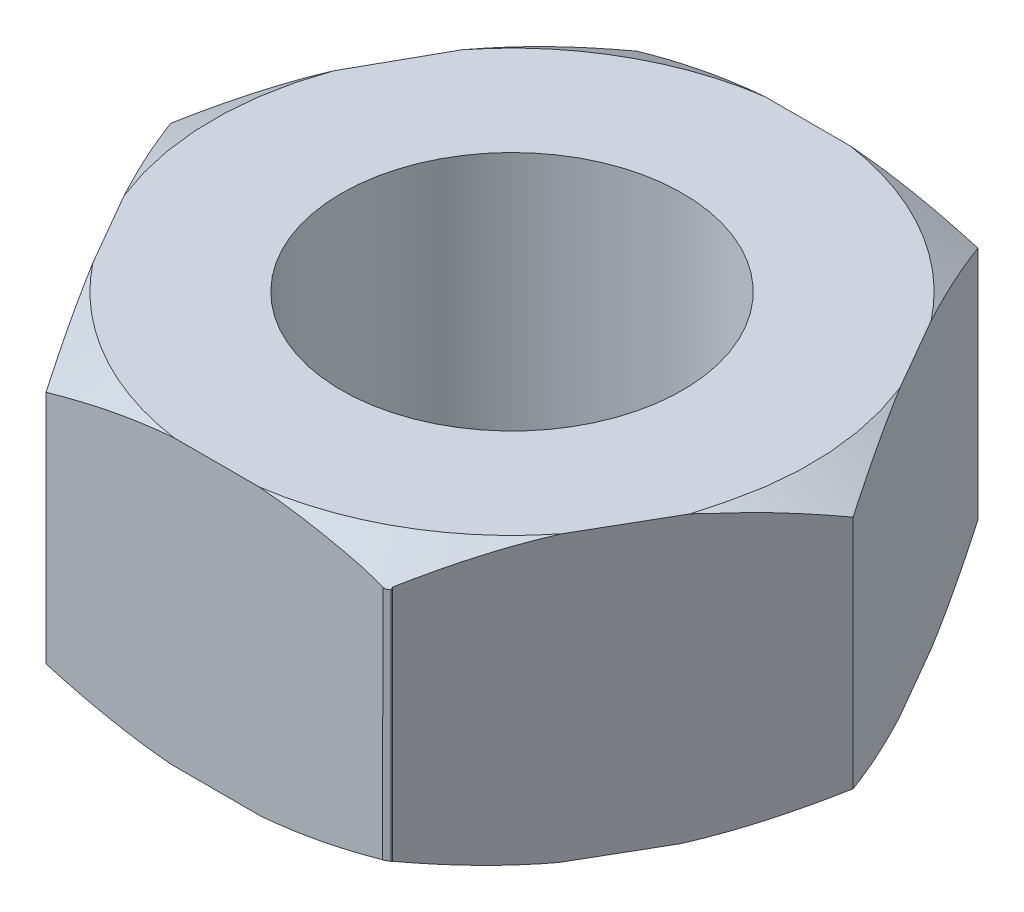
ISO-10303-21;
HEADER;
FILE_DESCRIPTION(('STEP AP214'),'2;1');
FILE_NAME('part.step','',(''),(''),'','','');
FILE_SCHEMA(('AUTOMOTIVE_DESIGN { 1 0 10303 214 1 1 1 1 }'));
ENDSEC;
DATA;
#1=APPLICATION_CONTEXT('core data for automotive mechanical design processes');
#2=APPLICATION_PROTOCOL_DEFINITION('international standard','automotive_design',2000,#1);
#3=PRODUCT_CONTEXT('',#1,'mechanical');
#4=PRODUCT('Part','Part','',(#3));
#5=PRODUCT_RELATED_PRODUCT_CATEGORY('part','',(#4));
#6=PRODUCT_DEFINITION_FORMATION('','',#4);
#7=PRODUCT_DEFINITION_CONTEXT('part definition',#1,'design');
#8=PRODUCT_DEFINITION('design','',#6,#7);
#9=PRODUCT_DEFINITION_SHAPE('','',#8);
#10=(LENGTH_UNIT() NAMED_UNIT(*) SI_UNIT(.MILLI.,.METRE.));
#11=(NAMED_UNIT(*) PLANE_ANGLE_UNIT() SI_UNIT($,.RADIAN.));
#12=(NAMED_UNIT(*) SI_UNIT($,.STERADIAN.) SOLID_ANGLE_UNIT());
#13=UNCERTAINTY_MEASURE_WITH_UNIT(LENGTH_MEASURE(1.E-05),#10,'distance_accuracy_value','');
#14=(GEOMETRIC_REPRESENTATION_CONTEXT(3) GLOBAL_UNCERTAINTY_ASSIGNED_CONTEXT((#13)) GLOBAL_UNIT_ASSIGNED_CONTEXT((#10,
#11,#12)) REPRESENTATION_CONTEXT('',''));
#15=CARTESIAN_POINT('',(0.,0.,0.));
#16=DIRECTION('',(0.,0.,1.));
#17=DIRECTION('',(1.,0.,0.));
#18=AXIS2_PLACEMENT_3D('',#15,#16,#17);
#19=CARTESIAN_POINT('',(0.,-4.57,0.));
#20=DIRECTION('',(0.,1.,0.));
#21=DIRECTION('',(0.,0.,1.));
#22=AXIS2_PLACEMENT_3D('',#19,#20,#21);
#23=CYLINDRICAL_SURFACE('',#22,6.);
#24=DIRECTION('',(0.,1.,0.));
#25=VECTOR('',#24,1.);
#26=CARTESIAN_POINT('',(3.04553371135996,-2.50150635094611,5.16959615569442));
#27=LINE('',#26,#25);
#28=CARTESIAN_POINT('',(3.04553371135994,-4.57,5.1695961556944));
#29=VERTEX_POINT('',#28);
#30=CARTESIAN_POINT('',(3.04553371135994,-0.43301270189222,5.1695961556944));
#31=VERTEX_POINT('',#30);
#32=EDGE_CURVE('E166',#29,#31,#27,.T.);
#33=ORIENTED_EDGE('',*,*,#32,.T.);
#34=CARTESIAN_POINT('',(0.,-0.433012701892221,0.));
#35=DIRECTION('',(0.,1.,0.));
#36=DIRECTION('',(0.,0.,1.));
#37=AXIS2_PLACEMENT_3D('',#34,#35,#36);
#38=CIRCLE('',#37,6.);
#39=CARTESIAN_POINT('',(2.945700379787,-0.425228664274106,5.21163935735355));
#40=VERTEX_POINT('',#39);
#41=EDGE_CURVE('E167',#40,#31,#38,.T.);
#42=ORIENTED_EDGE('',*,*,#41,.F.);
#43=DIRECTION('',(0.,-1.,0.));
#44=VECTOR('',#43,1.);
#45=CARTESIAN_POINT('',(2.945700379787,-2.5015063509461,5.2271262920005));
#46=LINE('',#45,#44);
#47=CARTESIAN_POINT('',(2.945700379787,-4.57,5.22712629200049));
#48=VERTEX_POINT('',#47);
#49=EDGE_CURVE('E170',#40,#48,#46,.T.);
#50=ORIENTED_EDGE('',*,*,#49,.T.);
#51=CARTESIAN_POINT('',(0.,-4.57,0.));
#52=DIRECTION('',(0.,1.,0.));
#53=DIRECTION('',(0.,0.,1.));
#54=AXIS2_PLACEMENT_3D('',#51,#52,#53);
#55=CIRCLE('',#54,6.);
#56=EDGE_CURVE('E154',#29,#48,#55,.F.);
#57=ORIENTED_EDGE('',*,*,#56,.F.);
#58=EDGE_LOOP('',(#33,#42,#50,#57));
#59=FACE_BOUND('',#58,.T.);
#60=ADVANCED_FACE('F15',(#59),#23,.T.);
#61=CARTESIAN_POINT('',(3.0338971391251,-0.41360896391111,5.1374408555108));
#62=DIRECTION('',(-0.9403207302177,0.,0.34028947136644));
#63=DIRECTION('',(0.,-1.,0.));
#64=AXIS2_PLACEMENT_3D('',#61,#62,#63);
#65=PLANE('',#64);
#66=CARTESIAN_POINT('',(3.03389713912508,-0.413608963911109,5.13744085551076));
#67=CARTESIAN_POINT('',(3.03438334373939,-0.414417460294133,5.13878004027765));
#68=CARTESIAN_POINT('',(3.03486937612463,-0.415225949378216,5.14011929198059));
#69=CARTESIAN_POINT('',(3.03584110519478,-0.416842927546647,5.14279795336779));
#70=CARTESIAN_POINT('',(3.03632680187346,-0.41765141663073,5.14413736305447));
#71=CARTESIAN_POINT('',(3.03729785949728,-0.41926839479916,5.14681634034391));
#72=CARTESIAN_POINT('',(3.03778322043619,-0.420076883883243,5.14815590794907));
#73=CARTESIAN_POINT('',(3.03875360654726,-0.421693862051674,5.15083520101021));
#74=CARTESIAN_POINT('',(3.03923863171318,-0.422502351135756,5.1521749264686));
#75=CARTESIAN_POINT('',(3.04020834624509,-0.424119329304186,5.1548545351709));
#76=CARTESIAN_POINT('',(3.04069303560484,-0.424927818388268,5.15619441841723));
#77=CARTESIAN_POINT('',(3.04166207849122,-0.426544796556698,5.15887434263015));
#78=CARTESIAN_POINT('',(3.04214643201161,-0.42735328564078,5.16021438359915));
#79=CARTESIAN_POINT('',(3.0431148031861,-0.42897026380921,5.16289462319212));
#80=CARTESIAN_POINT('',(3.04359882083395,-0.429778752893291,5.16423482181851));
#81=CARTESIAN_POINT('',(3.04456652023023,-0.43139573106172,5.16691537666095));
#82=CARTESIAN_POINT('',(3.0450502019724,-0.432204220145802,5.16825573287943));
#83=CARTESIAN_POINT('',(3.04553371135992,-0.43301270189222,5.16959615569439));
#84=B_SPLINE_CURVE_WITH_KNOTS('',3,(#66,#67,#68,#69,#70,#71,#72,#73,#74,#75,#76,#77,#78,#79,#80,
#81,#82,#83),.UNSPECIFIED.,.F.,.F.,(4,2,2,2,2,2,2,2,4),(0.,0.00491439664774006,
0.00982888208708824,0.0147434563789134,0.0196581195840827,0.0245728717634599,0.0294877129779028,
0.0344026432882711,0.0393176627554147),.UNSPECIFIED.);
#85=CARTESIAN_POINT('',(3.03389713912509,-0.413608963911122,5.13744085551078));
#86=VERTEX_POINT('',#85);
#87=EDGE_CURVE('E428',#86,#31,#84,.T.);
#88=ORIENTED_EDGE('',*,*,#87,.T.);
#89=ORIENTED_EDGE('',*,*,#32,.F.);
#90=CARTESIAN_POINT('',(3.04553371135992,-4.57,5.16959615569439));
#91=CARTESIAN_POINT('',(3.04535817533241,-4.5702930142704,5.16911052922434));
#92=CARTESIAN_POINT('',(3.0451826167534,-4.57058602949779,5.16862491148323));
#93=CARTESIAN_POINT('',(3.04483145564,-4.57117205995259,5.1676536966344));
#94=CARTESIAN_POINT('',(3.0446558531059,-4.57146507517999,5.16716809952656));
#95=CARTESIAN_POINT('',(3.04430460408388,-4.57205110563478,5.16619692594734));
#96=CARTESIAN_POINT('',(3.04412895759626,-4.57234412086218,5.16571134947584));
#97=CARTESIAN_POINT('',(3.04377762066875,-4.57293015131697,5.1647402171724));
#98=CARTESIAN_POINT('',(3.04360193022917,-4.57322316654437,5.16425466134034));
#99=CARTESIAN_POINT('',(3.04325050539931,-4.57380919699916,5.16328357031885));
#100=CARTESIAN_POINT('',(3.04307477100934,-4.57410221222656,5.1627980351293));
#101=CARTESIAN_POINT('',(3.04272325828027,-4.57468824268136,5.16182698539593));
#102=CARTESIAN_POINT('',(3.04254747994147,-4.57498125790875,5.16134147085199));
#103=CARTESIAN_POINT('',(3.04219587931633,-4.57556728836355,5.16037046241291));
#104=CARTESIAN_POINT('',(3.04202005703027,-4.57586030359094,5.15988496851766));
#105=CARTESIAN_POINT('',(3.04166836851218,-4.57644633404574,5.15891400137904));
#106=CARTESIAN_POINT('',(3.04149250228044,-4.57673934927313,5.15842852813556));
#107=CARTESIAN_POINT('',(3.04131661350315,-4.57703236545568,5.15794306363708));
#108=B_SPLINE_CURVE_WITH_KNOTS('',3,(#90,#91,#92,#93,#94,#95,#96,#97,#98,#99,#100,#101,#102,
#103,#104,#105,#106,#107),.UNSPECIFIED.,.F.,.F.,(4,2,2,2,2,2,2,2,4),(0.,0.00178115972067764,
0.00356230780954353,0.00534344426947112,0.00712456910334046,0.00890568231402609,
0.0106867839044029,0.0124678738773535,0.0142489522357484),.UNSPECIFIED.);
#109=CARTESIAN_POINT('',(3.04131758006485,-4.57703075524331,5.15794573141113));
#110=VERTEX_POINT('',#109);
#111=EDGE_CURVE('E162',#29,#110,#108,.T.);
#112=ORIENTED_EDGE('',*,*,#111,.T.);
#113=CARTESIAN_POINT('',(3.04131661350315,-4.57703236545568,5.15794306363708));
#114=CARTESIAN_POINT('',(3.04100801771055,-4.57754783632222,5.15708855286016));
#115=CARTESIAN_POINT('',(3.04069935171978,-4.57806331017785,5.15623406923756));
#116=CARTESIAN_POINT('',(3.04008188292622,-4.57909425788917,5.15452516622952));
#117=CARTESIAN_POINT('',(3.03977308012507,-4.57960973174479,5.15367074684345));
#118=CARTESIAN_POINT('',(3.03915533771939,-4.58064067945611,5.15196197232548));
#119=CARTESIAN_POINT('',(3.03884639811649,-4.58115615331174,5.15110761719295));
#120=CARTESIAN_POINT('',(3.03822838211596,-4.58218710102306,5.14939897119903));
#121=CARTESIAN_POINT('',(3.03791930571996,-4.58270257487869,5.14854468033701));
#122=CARTESIAN_POINT('',(3.03730101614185,-4.58373352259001,5.14683616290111));
#123=CARTESIAN_POINT('',(3.03699180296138,-4.58424899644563,5.1459819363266));
#124=CARTESIAN_POINT('',(3.03637323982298,-4.58527994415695,5.14427354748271));
#125=CARTESIAN_POINT('',(3.03606388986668,-4.58579541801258,5.14341938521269));
#126=CARTESIAN_POINT('',(3.03544505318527,-4.5868263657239,5.14171112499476));
#127=CARTESIAN_POINT('',(3.03513556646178,-4.58734183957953,5.14085702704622));
#128=CARTESIAN_POINT('',(3.03451645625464,-4.58837278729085,5.13914889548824));
#129=CARTESIAN_POINT('',(3.03420683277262,-4.58888826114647,5.13829486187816));
#130=CARTESIAN_POINT('',(3.03389713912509,-4.58940373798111,5.13744085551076));
#131=B_SPLINE_CURVE_WITH_KNOTS('',3,(#113,#114,#115,#116,#117,#118,#119,#120,#121,#122,#123,
#124,#125,#126,#127,#128,#129,#130),.UNSPECIFIED.,.F.,.F.,(4,2,2,2,2,2,2,2,4),(0.,
0.00313371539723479,0.00626739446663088,0.00940103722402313,0.0125346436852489,
0.015668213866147,0.0188017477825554,0.0219352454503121,0.0250687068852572),.UNSPECIFIED.);
#132=CARTESIAN_POINT('',(3.03389713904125,-4.58940373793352,5.137440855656));
#133=VERTEX_POINT('',#132);
#134=EDGE_CURVE('E179',#110,#133,#131,.T.);
#135=ORIENTED_EDGE('',*,*,#134,.T.);
#136=DIRECTION('',(0.,1.,0.));
#137=VECTOR('',#136,1.);
#138=CARTESIAN_POINT('',(3.0338971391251,-2.9661028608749,5.1374408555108));
#139=LINE('',#138,#137);
#140=EDGE_CURVE('E423',#133,#86,#139,.T.);
#141=ORIENTED_EDGE('',*,*,#140,.T.);
#142=EDGE_LOOP('',(#88,#89,#112,#135,#141));
#143=FACE_BOUND('',#142,.T.);
#144=ADVANCED_FACE('F529',(#143),#65,.F.);
#145=CARTESIAN_POINT('',(0.,-5.,0.));
#146=DIRECTION('',(0.,1.,0.));
#147=DIRECTION('',(-1.,0.,0.));
#148=AXIS2_PLACEMENT_3D('',#145,#146,#147);
#149=CONICAL_SURFACE('',#148,5.2552181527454,1.04719755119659);
#150=CARTESIAN_POINT('',(0.,-5.,0.));
#151=DIRECTION('',(0.,1.,0.));
#152=DIRECTION('',(-1.,0.,0.));
#153=AXIS2_PLACEMENT_3D('',#150,#151,#152);
#154=CIRCLE('',#153,5.2552181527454);
#155=CARTESIAN_POINT('',(4.89284788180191,-4.99999999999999,-1.91764372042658));
#156=VERTEX_POINT('',#155);
#157=CARTESIAN_POINT('',(4.8928478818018,-5.,1.91764372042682));
#158=VERTEX_POINT('',#157);
#159=EDGE_CURVE('E517',#156,#158,#154,.F.);
#160=ORIENTED_EDGE('',*,*,#159,.F.);
#161=CARTESIAN_POINT('',(4.89284788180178,-5.00000000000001,-1.9176437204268));
#162=CARTESIAN_POINT('',(4.93028036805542,-4.99353998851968,-1.8528087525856));
#163=CARTESIAN_POINT('',(4.96767334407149,-4.98617963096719,-1.788042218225));
#164=CARTESIAN_POINT('',(5.0496059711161,-4.9681259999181,-1.64613074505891));
#165=CARTESIAN_POINT('',(5.09412535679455,-4.95706319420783,-1.56902090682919));
#166=CARTESIAN_POINT('',(5.18323026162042,-4.93250617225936,-1.41468668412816));
#167=CARTESIAN_POINT('',(5.22781493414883,-4.91899968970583,-1.33746376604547));
#168=CARTESIAN_POINT('',(5.3089107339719,-4.89231737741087,-1.19700172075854));
#169=CARTESIAN_POINT('',(5.3454523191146,-4.87950718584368,-1.13370983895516));
#170=CARTESIAN_POINT('',(5.5902275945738,-4.7886589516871,-0.709746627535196));
#171=CARTESIAN_POINT('',(5.79637887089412,-4.68761566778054,-0.35268214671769));
#172=CARTESIAN_POINT('',(6.,-4.57000000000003,0.));
#173=B_SPLINE_CURVE_WITH_KNOTS('',3,(#161,#162,#163,#164,#165,#166,#167,#168,#169,#170,#171,
#172),.UNSPECIFIED.,.F.,.F.,(4,2,2,2,2,4),(0.,0.225422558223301,0.494558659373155,
0.765085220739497,0.98766667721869,2.25874875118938),.UNSPECIFIED.);
#174=CARTESIAN_POINT('',(6.,-4.57,0.));
#175=VERTEX_POINT('',#174);
#176=EDGE_CURVE('E389',#156,#175,#173,.T.);
#177=ORIENTED_EDGE('',*,*,#176,.T.);
#178=CARTESIAN_POINT('',(6.,-4.57,0.));
#179=CARTESIAN_POINT('',(5.94506677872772,-4.60171308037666,0.0951471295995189));
#180=CARTESIAN_POINT('',(5.88996351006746,-4.6322228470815,0.190588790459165));
#181=CARTESIAN_POINT('',(5.78984899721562,-4.68504858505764,0.363992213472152));
#182=CARTESIAN_POINT('',(5.74489824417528,-4.70782348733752,0.441849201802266));
#183=CARTESIAN_POINT('',(5.59448692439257,-4.78063950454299,0.702369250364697));
#184=CARTESIAN_POINT('',(5.48849146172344,-4.82641586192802,0.885958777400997));
#185=CARTESIAN_POINT('',(5.32747591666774,-4.88618035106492,1.16484588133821));
#186=CARTESIAN_POINT('',(5.2728755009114,-4.90476661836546,1.25941657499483));
#187=CARTESIAN_POINT('',(5.17366229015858,-4.93528827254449,1.43125889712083));
#188=CARTESIAN_POINT('',(5.12909535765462,-4.9478173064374,1.50845108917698));
#189=CARTESIAN_POINT('',(5.04005316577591,-4.97038232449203,1.66267668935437));
#190=CARTESIAN_POINT('',(4.99557876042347,-4.98043170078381,1.7397086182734));
#191=CARTESIAN_POINT('',(4.93165606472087,-4.99305766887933,1.85042597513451));
#192=CARTESIAN_POINT('',(4.91225708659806,-4.99664964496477,1.88402599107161));
#193=CARTESIAN_POINT('',(4.89284788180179,-5.,1.91764372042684));
#194=B_SPLINE_CURVE_WITH_KNOTS('',3,(#178,#179,#180,#181,#182,#183,#184,#185,#186,#187,#188,
#189,#190,#191,#192,#193),.UNSPECIFIED.,.F.,.F.,(4,2,2,2,2,2,2,4),(0.,0.343031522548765,
0.621244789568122,1.27149514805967,1.60376214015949,1.8737609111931,2.14226788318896,
2.25915653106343),.UNSPECIFIED.);
#195=EDGE_CURVE('E431',#175,#158,#194,.T.);
#196=ORIENTED_EDGE('',*,*,#195,.T.);
#197=EDGE_LOOP('',(#160,#177,#196));
#198=FACE_BOUND('',#197,.T.);
#199=ADVANCED_FACE('F375',(#198),#149,.T.);
#200=CARTESIAN_POINT('',(0.,-5.,0.));
#201=DIRECTION('',(0.,1.,0.));
#202=DIRECTION('',(-1.,0.,0.));
#203=AXIS2_PLACEMENT_3D('',#200,#201,#202);
#204=CONICAL_SURFACE('',#203,5.2552181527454,1.04719755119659);
#205=CARTESIAN_POINT('',(0.,-5.,0.));
#206=DIRECTION('',(0.,1.,0.));
#207=DIRECTION('',(-1.,0.,0.));
#208=AXIS2_PLACEMENT_3D('',#205,#206,#207);
#209=CIRCLE('',#208,5.2552181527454);
#210=CARTESIAN_POINT('',(0.785695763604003,-4.99999999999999,-5.1961524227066));
#211=VERTEX_POINT('',#210);
#212=CARTESIAN_POINT('',(4.10715211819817,-5.00000000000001,-3.27850870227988));
#213=VERTEX_POINT('',#212);
#214=EDGE_CURVE('E552',#211,#213,#209,.F.);
#215=ORIENTED_EDGE('',*,*,#214,.F.);
#216=CARTESIAN_POINT('',(0.78569576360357,-5.00000000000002,-5.19615242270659));
#217=CARTESIAN_POINT('',(0.981514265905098,-4.98313136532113,-5.19615242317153));
#218=CARTESIAN_POINT('',(1.17670737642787,-4.96005695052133,-5.1961524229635));
#219=CARTESIAN_POINT('',(1.46350340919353,-4.91780635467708,-5.19615242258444));
#220=CARTESIAN_POINT('',(1.5557433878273,-4.90293299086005,-5.19615242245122));
#221=CARTESIAN_POINT('',(1.740402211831,-4.87070709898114,-5.19615242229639));
#222=CARTESIAN_POINT('',(1.83281837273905,-4.85333919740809,-5.1961524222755));
#223=CARTESIAN_POINT('',(2.00093186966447,-4.81962080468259,-5.19615242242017));
#224=CARTESIAN_POINT('',(2.07670233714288,-4.80363139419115,-5.19615242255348));
#225=CARTESIAN_POINT('',(2.43712393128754,-4.72399927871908,-5.19615242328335));
#226=CARTESIAN_POINT('',(2.71971766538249,-4.65090191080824,-5.19615242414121));
#227=CARTESIAN_POINT('',(3.,-4.57000000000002,-5.1961524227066));
#228=B_SPLINE_CURVE_WITH_KNOTS('',3,(#216,#217,#218,#219,#220,#221,#222,#223,#224,#225,#226,
#227),.UNSPECIFIED.,.F.,.F.,(4,2,2,2,2,4),(0.,0.589384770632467,0.869646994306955,
1.15171711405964,1.38402368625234,2.25902270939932),.UNSPECIFIED.);
#229=CARTESIAN_POINT('',(3.,-4.57000000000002,-5.1961524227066));
#230=VERTEX_POINT('',#229);
#231=EDGE_CURVE('E361',#211,#230,#228,.T.);
#232=ORIENTED_EDGE('',*,*,#231,.T.);
#233=CARTESIAN_POINT('',(3.,-4.57000000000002,-5.1961524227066));
#234=CARTESIAN_POINT('',(3.0400548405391,-4.59312524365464,-5.12677540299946));
#235=CARTESIAN_POINT('',(3.08020081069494,-4.61560937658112,-5.05724054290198));
#236=CARTESIAN_POINT('',(3.15315477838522,-4.65511616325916,-4.9308805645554));
#237=CARTESIAN_POINT('',(3.18593097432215,-4.67237381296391,-4.87411052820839));
#238=CARTESIAN_POINT('',(3.31524558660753,-4.73841654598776,-4.65013105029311));
#239=CARTESIAN_POINT('',(3.41226794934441,-4.783493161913,-4.48208338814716));
#240=CARTESIAN_POINT('',(3.60733635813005,-4.86370629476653,-4.1442149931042));
#241=CARTESIAN_POINT('',(3.70538225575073,-4.89884423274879,-3.97439451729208));
#242=CARTESIAN_POINT('',(3.85001100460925,-4.94207017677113,-3.72389017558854));
#243=CARTESIAN_POINT('',(3.89626662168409,-4.95461241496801,-3.64377309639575));
#244=CARTESIAN_POINT('',(3.98033096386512,-4.97497406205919,-3.49816938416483));
#245=CARTESIAN_POINT('',(4.01811258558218,-4.98323799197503,-3.43272969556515));
#246=CARTESIAN_POINT('',(4.07300057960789,-4.99391630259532,-3.33766090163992));
#247=CARTESIAN_POINT('',(4.09007238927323,-4.99705166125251,-3.30809166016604));
#248=CARTESIAN_POINT('',(4.10715211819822,-5.00000000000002,-3.2785087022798));
#249=B_SPLINE_CURVE_WITH_KNOTS('',3,(#233,#234,#235,#236,#237,#238,#239,#240,#241,#242,#243,
#244,#245,#246,#247,#248),.UNSPECIFIED.,.F.,.F.,(4,2,2,2,2,2,2,4),(0.,0.250133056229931,
0.453486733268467,1.05089149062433,1.6482107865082,1.92825157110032,2.15626987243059,
2.25912962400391),.UNSPECIFIED.);
#250=EDGE_CURVE('E381',#230,#213,#249,.T.);
#251=ORIENTED_EDGE('',*,*,#250,.T.);
#252=EDGE_LOOP('',(#215,#232,#251));
#253=FACE_BOUND('',#252,.T.);
#254=ADVANCED_FACE('F371',(#253),#204,.T.);
#255=CARTESIAN_POINT('',(0.,-5.,0.));
#256=DIRECTION('',(0.,1.,0.));
#257=DIRECTION('',(-1.,0.,0.));
#258=AXIS2_PLACEMENT_3D('',#255,#256,#257);
#259=CONICAL_SURFACE('',#258,5.2552181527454,1.04719755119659);
#260=CARTESIAN_POINT('',(0.,-5.,0.));
#261=DIRECTION('',(0.,1.,0.));
#262=DIRECTION('',(-1.,0.,0.));
#263=AXIS2_PLACEMENT_3D('',#260,#261,#262);
#264=CIRCLE('',#263,5.2552181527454);
#265=CARTESIAN_POINT('',(-4.10715211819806,-4.99999999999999,-3.27850870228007));
#266=VERTEX_POINT('',#265);
#267=CARTESIAN_POINT('',(-0.785695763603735,-5.00000000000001,-5.1961524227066));
#268=VERTEX_POINT('',#267);
#269=EDGE_CURVE('E527',#266,#268,#264,.F.);
#270=ORIENTED_EDGE('',*,*,#269,.F.);
#271=CARTESIAN_POINT('',(-4.10715211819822,-5.00000000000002,-3.27850870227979));
#272=CARTESIAN_POINT('',(-4.07476458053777,-4.99441128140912,-3.33460556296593));
#273=CARTESIAN_POINT('',(-4.04240544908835,-4.98814731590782,-3.39065322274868));
#274=CARTESIAN_POINT('',(-3.94116232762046,-4.96648041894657,-3.56601145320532));
#275=CARTESIAN_POINT('',(-3.87239944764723,-4.94875917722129,-3.6851122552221));
#276=CARTESIAN_POINT('',(-3.75316021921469,-4.91312561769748,-3.89164065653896));
#277=CARTESIAN_POINT('',(-3.7025882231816,-4.89646657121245,-3.97923392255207));
#278=CARTESIAN_POINT('',(-3.61059220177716,-4.8635104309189,-4.13857570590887));
#279=CARTESIAN_POINT('',(-3.56912735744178,-4.84766738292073,-4.21039492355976));
#280=CARTESIAN_POINT('',(-3.47100322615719,-4.80795646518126,-4.38035090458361));
#281=CARTESIAN_POINT('',(-3.41442397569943,-4.78329441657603,-4.47834904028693));
#282=CARTESIAN_POINT('',(-3.31148419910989,-4.73546481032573,-4.6566459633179));
#283=CARTESIAN_POINT('',(-3.26506594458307,-4.71278935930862,-4.73704473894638));
#284=CARTESIAN_POINT('',(-3.14553978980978,-4.65174510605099,-4.94407011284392));
#285=CARTESIAN_POINT('',(-3.07261660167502,-4.61192157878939,-5.07037678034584));
#286=CARTESIAN_POINT('',(-3.,-4.57000000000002,-5.1961524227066));
#287=B_SPLINE_CURVE_WITH_KNOTS('',3,(#271,#272,#273,#274,#275,#276,#277,#278,#279,#280,#281,
#282,#283,#284,#285,#286),.UNSPECIFIED.,.F.,.F.,(4,2,2,2,2,2,2,4),(0.,0.195048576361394,
0.610900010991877,0.918381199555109,1.17164973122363,1.51904182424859,1.80571983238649,
2.25919314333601),.UNSPECIFIED.);
#288=CARTESIAN_POINT('',(-3.,-4.57000000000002,-5.1961524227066));
#289=VERTEX_POINT('',#288);
#290=EDGE_CURVE('E302',#266,#289,#287,.T.);
#291=ORIENTED_EDGE('',*,*,#290,.T.);
#292=CARTESIAN_POINT('',(-3.,-4.57000000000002,-5.1961524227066));
#293=CARTESIAN_POINT('',(-2.84500158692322,-4.61473971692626,-5.19615242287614));
#294=CARTESIAN_POINT('',(-2.68929115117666,-4.65709424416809,-5.19615242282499));
#295=CARTESIAN_POINT('',(-2.4064812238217,-4.72864001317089,-5.19615242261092));
#296=CARTESIAN_POINT('',(-2.27962477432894,-4.75879762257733,-5.19615242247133));
#297=CARTESIAN_POINT('',(-2.03946671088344,-4.81185808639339,-5.19615242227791));
#298=CARTESIAN_POINT('',(-1.92626180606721,-4.83519588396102,-5.19615242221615));
#299=CARTESIAN_POINT('',(-1.72058076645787,-4.87431111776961,-5.19615242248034));
#300=CARTESIAN_POINT('',(-1.62821781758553,-4.89068454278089,-5.19615242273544));
#301=CARTESIAN_POINT('',(-1.44372091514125,-4.92087402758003,-5.19615242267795));
#302=CARTESIAN_POINT('',(-1.35158971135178,-4.93470680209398,-5.19615242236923));
#303=CARTESIAN_POINT('',(-1.18415933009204,-4.95747442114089,-5.19615242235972));
#304=CARTESIAN_POINT('',(-1.10891882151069,-4.96684169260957,-5.19615242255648));
#305=CARTESIAN_POINT('',(-0.951063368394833,-4.98462288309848,-5.19615242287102));
#306=CARTESIAN_POINT('',(-0.868428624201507,-4.99286101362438,-5.19615242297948));
#307=CARTESIAN_POINT('',(-0.785695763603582,-5.00000000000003,-5.1961524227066));
#308=B_SPLINE_CURVE_WITH_KNOTS('',3,(#292,#293,#294,#295,#296,#297,#298,#299,#300,#301,#302,
#303,#304,#305,#306,#307),.UNSPECIFIED.,.F.,.F.,(4,2,2,2,2,2,2,4),(0.,0.483988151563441,
0.875109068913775,1.22181246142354,1.50319175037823,1.78264780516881,2.01009213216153,
2.25920024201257),.UNSPECIFIED.);
#309=EDGE_CURVE('E367',#289,#268,#308,.T.);
#310=ORIENTED_EDGE('',*,*,#309,.T.);
#311=EDGE_LOOP('',(#270,#291,#310));
#312=FACE_BOUND('',#311,.T.);
#313=ADVANCED_FACE('F288',(#312),#259,.T.);
#314=CARTESIAN_POINT('',(0.,-5.,0.));
#315=DIRECTION('',(0.,1.,0.));
#316=DIRECTION('',(-1.,0.,0.));
#317=AXIS2_PLACEMENT_3D('',#314,#315,#316);
#318=CONICAL_SURFACE('',#317,5.2552181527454,1.04719755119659);
#319=CARTESIAN_POINT('',(0.,-5.,0.));
#320=DIRECTION('',(0.,1.,0.));
#321=DIRECTION('',(-1.,0.,0.));
#322=AXIS2_PLACEMENT_3D('',#319,#320,#321);
#323=CIRCLE('',#322,5.2552181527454);
#324=CARTESIAN_POINT('',(-4.89284788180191,-4.99999999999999,1.91764372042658));
#325=VERTEX_POINT('',#324);
#326=CARTESIAN_POINT('',(-4.89284788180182,-5.00000000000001,-1.91764372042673));
#327=VERTEX_POINT('',#326);
#328=EDGE_CURVE('E525',#325,#327,#323,.F.);
#329=ORIENTED_EDGE('',*,*,#328,.F.);
#330=CARTESIAN_POINT('',(-4.89284788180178,-5.00000000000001,1.91764372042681));
#331=CARTESIAN_POINT('',(-4.93028036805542,-4.99353998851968,1.8528087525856));
#332=CARTESIAN_POINT('',(-4.96767334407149,-4.9861796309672,1.788042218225));
#333=CARTESIAN_POINT('',(-5.0496059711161,-4.9681259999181,1.64613074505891));
#334=CARTESIAN_POINT('',(-5.09412535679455,-4.95706319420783,1.56902090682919));
#335=CARTESIAN_POINT('',(-5.18323026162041,-4.93250617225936,1.41468668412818));
#336=CARTESIAN_POINT('',(-5.22781493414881,-4.91899968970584,1.3374637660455));
#337=CARTESIAN_POINT('',(-5.30891073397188,-4.89231737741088,1.19700172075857));
#338=CARTESIAN_POINT('',(-5.34545231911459,-4.87950718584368,1.13370983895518));
#339=CARTESIAN_POINT('',(-5.5902275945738,-4.7886589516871,0.709746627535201));
#340=CARTESIAN_POINT('',(-5.79637887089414,-4.68761566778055,0.352682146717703));
#341=CARTESIAN_POINT('',(-6.,-4.57000000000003,0.));
#342=B_SPLINE_CURVE_WITH_KNOTS('',3,(#330,#331,#332,#333,#334,#335,#336,#337,#338,#339,#340,
#341),.UNSPECIFIED.,.F.,.F.,(4,2,2,2,2,4),(0.,0.225422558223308,0.49455865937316,
0.765085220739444,0.987666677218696,2.25874875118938),.UNSPECIFIED.);
#343=CARTESIAN_POINT('',(-6.,-4.57,0.));
#344=VERTEX_POINT('',#343);
#345=EDGE_CURVE('E272',#325,#344,#342,.T.);
#346=ORIENTED_EDGE('',*,*,#345,.T.);
#347=CARTESIAN_POINT('',(-6.,-4.57,0.));
#348=CARTESIAN_POINT('',(-5.94506677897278,-4.60171308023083,-0.0951471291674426));
#349=CARTESIAN_POINT('',(-5.88996351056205,-4.6322228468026,-0.190588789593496));
#350=CARTESIAN_POINT('',(-5.78984899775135,-4.68504858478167,-0.363992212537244));
#351=CARTESIAN_POINT('',(-5.74489824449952,-4.70782348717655,-0.441849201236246));
#352=CARTESIAN_POINT('',(-5.59448692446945,-4.78063950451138,-0.7023692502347));
#353=CARTESIAN_POINT('',(-5.48849146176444,-4.82641586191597,-0.885958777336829));
#354=CARTESIAN_POINT('',(-5.32747591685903,-4.88618035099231,-1.16484588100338));
#355=CARTESIAN_POINT('',(-5.27287550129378,-4.90476661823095,-1.25941657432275));
#356=CARTESIAN_POINT('',(-5.17366229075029,-4.93528827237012,-1.43125889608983));
#357=CARTESIAN_POINT('',(-5.12909535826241,-4.94781730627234,-1.50845108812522));
#358=CARTESIAN_POINT('',(-5.0400531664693,-4.97038232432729,-1.66267668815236));
#359=CARTESIAN_POINT('',(-4.99557876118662,-4.98043170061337,-1.73970861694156));
#360=CARTESIAN_POINT('',(-4.93165606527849,-4.993057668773,-1.85042597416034));
#361=CARTESIAN_POINT('',(-4.91225708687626,-4.99664964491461,-1.88402599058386));
#362=CARTESIAN_POINT('',(-4.89284788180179,-5.00000000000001,-1.91764372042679));
#363=B_SPLINE_CURVE_WITH_KNOTS('',3,(#347,#348,#349,#350,#351,#352,#353,#354,#355,#356,#357,
#358,#359,#360,#361,#362),.UNSPECIFIED.,.F.,.F.,(4,2,2,2,2,2,2,4),(0.,0.343031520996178,
0.621244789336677,1.27149514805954,1.60376213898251,1.8737609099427,2.14226788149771,
2.25915653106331),.UNSPECIFIED.);
#364=EDGE_CURVE('E294',#344,#327,#363,.T.);
#365=ORIENTED_EDGE('',*,*,#364,.T.);
#366=EDGE_LOOP('',(#329,#346,#365));
#367=FACE_BOUND('',#366,.T.);
#368=ADVANCED_FACE('F284',(#367),#318,.T.);
#369=CARTESIAN_POINT('',(2.945700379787,-0.417444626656,5.2271262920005));
#370=DIRECTION('',(1.,0.,0.));
#371=DIRECTION('',(0.,-1.,0.));
#372=AXIS2_PLACEMENT_3D('',#369,#370,#371);
#373=PLANE('',#372);
#374=CARTESIAN_POINT('',(2.945700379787,-4.58556807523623,5.19615242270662));
#375=CARTESIAN_POINT('',(2.945700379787,-4.58297488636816,5.20131548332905));
#376=CARTESIAN_POINT('',(2.945700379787,-4.58038095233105,5.20647816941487));
#377=CARTESIAN_POINT('',(2.945700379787,-4.57519159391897,5.21680279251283));
#378=CARTESIAN_POINT('',(2.945700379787,-4.57259616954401,5.22196472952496));
#379=CARTESIAN_POINT('',(2.945700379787,-4.57,5.22712629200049));
#380=B_SPLINE_CURVE_WITH_KNOTS('',3,(#374,#375,#376,#377,#378,#379),.UNSPECIFIED.,.F.,.F.,(4,2,
4),(0.,0.01733310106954,0.034666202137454),.UNSPECIFIED.);
#381=CARTESIAN_POINT('',(2.945700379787,-4.58556807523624,5.19615242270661));
#382=VERTEX_POINT('',#381);
#383=EDGE_CURVE('E160',#382,#48,#380,.T.);
#384=ORIENTED_EDGE('',*,*,#383,.T.);
#385=ORIENTED_EDGE('',*,*,#49,.F.);
#386=DIRECTION('',(0.,-1.,0.));
#387=VECTOR('',#386,1.);
#388=CARTESIAN_POINT('',(2.945700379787,-2.9728501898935,5.1961524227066));
#389=LINE('',#388,#387);
#390=EDGE_CURVE('E177',#40,#382,#389,.T.);
#391=ORIENTED_EDGE('',*,*,#390,.T.);
#392=EDGE_LOOP('',(#384,#385,#391));
#393=FACE_BOUND('',#392,.T.);
#394=ADVANCED_FACE('F175',(#393),#373,.F.);
#395=CARTESIAN_POINT('',(0.,-5.,0.));
#396=DIRECTION('',(0.,1.,0.));
#397=DIRECTION('',(-1.,0.,0.));
#398=AXIS2_PLACEMENT_3D('',#395,#396,#397);
#399=CONICAL_SURFACE('',#398,5.2552181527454,1.04719755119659);
#400=CARTESIAN_POINT('',(0.,-5.,0.));
#401=DIRECTION('',(0.,1.,0.));
#402=DIRECTION('',(-1.,0.,0.));
#403=AXIS2_PLACEMENT_3D('',#400,#401,#402);
#404=CIRCLE('',#403,5.2552181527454);
#405=CARTESIAN_POINT('',(4.10715211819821,-4.99999999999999,3.27850870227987));
#406=VERTEX_POINT('',#405);
#407=CARTESIAN_POINT('',(0.785695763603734,-5.00000000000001,5.1961524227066));
#408=VERTEX_POINT('',#407);
#409=EDGE_CURVE('E432',#406,#408,#404,.F.);
#410=ORIENTED_EDGE('',*,*,#409,.F.);
#411=CARTESIAN_POINT('',(4.10715211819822,-4.99999999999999,3.27850870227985));
#412=CARTESIAN_POINT('',(4.07476395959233,-4.99440991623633,3.33460663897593));
#413=CARTESIAN_POINT('',(4.04240484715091,-4.98814637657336,3.3906542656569));
#414=CARTESIAN_POINT('',(3.9722420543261,-4.97313269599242,3.51217978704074));
#415=CARTESIAN_POINT('',(3.93445126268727,-4.96414064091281,3.57763535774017));
#416=CARTESIAN_POINT('',(3.86572136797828,-4.94619034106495,3.69667902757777));
#417=CARTESIAN_POINT('',(3.83476374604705,-4.93751276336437,3.75029920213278));
#418=CARTESIAN_POINT('',(3.75316241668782,-4.9131251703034,3.89163685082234));
#419=CARTESIAN_POINT('',(3.70258877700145,-4.89646646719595,3.97923296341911));
#420=CARTESIAN_POINT('',(3.61059176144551,-4.86351052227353,4.13857646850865));
#421=CARTESIAN_POINT('',(3.56912721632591,-4.84766740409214,4.21039516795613));
#422=CARTESIAN_POINT('',(3.47100341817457,-4.8079564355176,4.38035057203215));
#423=CARTESIAN_POINT('',(3.41442406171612,-4.78329444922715,4.47834889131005));
#424=CARTESIAN_POINT('',(3.3114841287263,-4.73546478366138,4.65664608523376));
#425=CARTESIAN_POINT('',(3.26506581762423,-4.71278924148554,4.73704495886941));
#426=CARTESIAN_POINT('',(3.15692646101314,-4.65756056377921,4.92434781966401));
#427=CARTESIAN_POINT('',(3.09530203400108,-4.6242478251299,5.03108445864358));
#428=CARTESIAN_POINT('',(3.03389713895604,-4.58940373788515,5.13744085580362));
#429=B_SPLINE_CURVE_WITH_KNOTS('',3,(#411,#412,#413,#414,#415,#416,#417,#418,#419,#420,#421,
#422,#423,#424,#425,#426,#427,#428),.UNSPECIFIED.,.F.,.F.,(4,2,2,2,2,2,2,2,4),(0.,
0.195048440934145,0.42337008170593,0.610922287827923,0.918403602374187,1.17167213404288,
1.51906422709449,1.80574222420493,2.18870604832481),.UNSPECIFIED.);
#430=EDGE_CURVE('E427',#406,#133,#429,.T.);
#431=ORIENTED_EDGE('',*,*,#430,.T.);
#432=ORIENTED_EDGE('',*,*,#134,.F.);
#433=ORIENTED_EDGE('',*,*,#111,.F.);
#434=ORIENTED_EDGE('',*,*,#56,.T.);
#435=ORIENTED_EDGE('',*,*,#383,.F.);
#436=CARTESIAN_POINT('',(2.94570037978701,-4.58556807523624,5.19615242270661));
#437=CARTESIAN_POINT('',(2.80060569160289,-4.62687760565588,5.19615242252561));
#438=CARTESIAN_POINT('',(2.65488872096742,-4.6660615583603,5.19615242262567));
#439=CARTESIAN_POINT('',(2.39021074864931,-4.73249904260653,5.19615242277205));
#440=CARTESIAN_POINT('',(2.27146163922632,-4.76060114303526,5.19615242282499));
#441=CARTESIAN_POINT('',(2.03946683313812,-4.81185809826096,5.19615242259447));
#442=CARTESIAN_POINT('',(1.9262618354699,-4.83519588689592,5.19615242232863));
#443=CARTESIAN_POINT('',(1.7205807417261,-4.87431111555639,5.1961524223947));
#444=CARTESIAN_POINT('',(1.62821781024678,-4.8906845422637,5.19615242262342));
#445=CARTESIAN_POINT('',(1.44372091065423,-4.92087403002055,5.19615242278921));
#446=CARTESIAN_POINT('',(1.35158969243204,-4.9347068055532,5.19615242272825));
#447=CARTESIAN_POINT('',(1.18415928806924,-4.95747442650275,5.19615242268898));
#448=CARTESIAN_POINT('',(1.10891876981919,-4.96684169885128,5.19615242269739));
#449=CARTESIAN_POINT('',(0.951063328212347,-4.98462288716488,5.19615242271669));
#450=CARTESIAN_POINT('',(0.868428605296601,-4.99286101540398,5.19615242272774));
#451=CARTESIAN_POINT('',(0.78569576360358,-5.00000000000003,5.1961524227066));
#452=B_SPLINE_CURVE_WITH_KNOTS('',3,(#436,#437,#438,#439,#440,#441,#442,#443,#444,#445,#446,
#447,#448,#449,#450,#451),.UNSPECIFIED.,.F.,.F.,(4,2,2,2,2,2,2,4),(0.,0.452585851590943,
0.818628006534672,1.16533140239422,1.44671069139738,1.72616677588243,1.95361113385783,
2.20271918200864),.UNSPECIFIED.);
#453=EDGE_CURVE('E208',#382,#408,#452,.T.);
#454=ORIENTED_EDGE('',*,*,#453,.T.);
#455=EDGE_LOOP('',(#410,#431,#432,#433,#434,#435,#454));
#456=FACE_BOUND('',#455,.T.);
#457=ADVANCED_FACE('F157',(#456),#399,.T.);
#458=CARTESIAN_POINT('',(0.,-5.,0.));
#459=DIRECTION('',(0.,1.,0.));
#460=DIRECTION('',(-1.,0.,0.));
#461=AXIS2_PLACEMENT_3D('',#458,#459,#460);
#462=CONICAL_SURFACE('',#461,5.2552181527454,1.04719755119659);
#463=CARTESIAN_POINT('',(0.,-5.,0.));
#464=DIRECTION('',(0.,1.,0.));
#465=DIRECTION('',(-1.,0.,0.));
#466=AXIS2_PLACEMENT_3D('',#463,#464,#465);
#467=CIRCLE('',#466,5.2552181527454);
#468=CARTESIAN_POINT('',(-0.785695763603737,-4.99999999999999,5.1961524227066));
#469=VERTEX_POINT('',#468);
#470=CARTESIAN_POINT('',(-4.10715211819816,-5.00000000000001,3.27850870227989));
#471=VERTEX_POINT('',#470);
#472=EDGE_CURVE('E188',#469,#471,#467,.F.);
#473=ORIENTED_EDGE('',*,*,#472,.F.);
#474=CARTESIAN_POINT('',(-0.785695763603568,-5.00000000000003,5.1961524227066));
#475=CARTESIAN_POINT('',(-0.981514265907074,-4.98313136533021,5.19615242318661));
#476=CARTESIAN_POINT('',(-1.17670737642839,-4.96005695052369,5.19615242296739));
#477=CARTESIAN_POINT('',(-1.46350340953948,-4.91780635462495,5.19615242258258));
#478=CARTESIAN_POINT('',(-1.55574338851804,-4.90293299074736,5.19615242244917));
#479=CARTESIAN_POINT('',(-1.74040221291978,-4.87070709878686,5.1961524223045));
#480=CARTESIAN_POINT('',(-1.83281837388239,-4.8533391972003,5.19615242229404));
#481=CARTESIAN_POINT('',(-2.00093187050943,-4.81962080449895,5.19615242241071));
#482=CARTESIAN_POINT('',(-2.07670233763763,-4.80363139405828,5.19615242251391));
#483=CARTESIAN_POINT('',(-2.43712393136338,-4.72399927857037,5.19615242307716));
#484=CARTESIAN_POINT('',(-2.71971766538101,-4.65090191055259,5.19615242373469));
#485=CARTESIAN_POINT('',(-3.,-4.57000000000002,5.1961524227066));
#486=B_SPLINE_CURVE_WITH_KNOTS('',3,(#474,#475,#476,#477,#478,#479,#480,#481,#482,#483,#484,
#485),.UNSPECIFIED.,.F.,.F.,(4,2,2,2,2,4),(0.,0.589384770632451,0.869646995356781,
1.15171711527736,1.3840236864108,2.25902270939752),.UNSPECIFIED.);
#487=CARTESIAN_POINT('',(-3.,-4.57000000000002,5.1961524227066));
#488=VERTEX_POINT('',#487);
#489=EDGE_CURVE('E215',#469,#488,#486,.T.);
#490=ORIENTED_EDGE('',*,*,#489,.T.);
#491=CARTESIAN_POINT('',(-3.,-4.57000000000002,5.1961524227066));
#492=CARTESIAN_POINT('',(-3.04005484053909,-4.59312524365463,5.12677540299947));
#493=CARTESIAN_POINT('',(-3.08020081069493,-4.61560937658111,5.05724054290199));
#494=CARTESIAN_POINT('',(-3.15315477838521,-4.65511616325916,4.93088056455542));
#495=CARTESIAN_POINT('',(-3.18593097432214,-4.67237381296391,4.87411052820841));
#496=CARTESIAN_POINT('',(-3.31524558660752,-4.73841654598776,4.65013105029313));
#497=CARTESIAN_POINT('',(-3.4122679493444,-4.783493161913,4.48208338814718));
#498=CARTESIAN_POINT('',(-3.60733635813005,-4.86370629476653,4.14421499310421));
#499=CARTESIAN_POINT('',(-3.70538225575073,-4.89884423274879,3.97439451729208));
#500=CARTESIAN_POINT('',(-3.85001100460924,-4.94207017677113,3.72389017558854));
#501=CARTESIAN_POINT('',(-3.89626662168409,-4.95461241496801,3.64377309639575));
#502=CARTESIAN_POINT('',(-3.98033096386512,-4.97497406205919,3.49816938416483));
#503=CARTESIAN_POINT('',(-4.01811258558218,-4.98323799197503,3.43272969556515));
#504=CARTESIAN_POINT('',(-4.07300057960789,-4.99391630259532,3.33766090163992));
#505=CARTESIAN_POINT('',(-4.09007238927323,-4.99705166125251,3.30809166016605));
#506=CARTESIAN_POINT('',(-4.10715211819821,-5.00000000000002,3.27850870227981));
#507=B_SPLINE_CURVE_WITH_KNOTS('',3,(#491,#492,#493,#494,#495,#496,#497,#498,#499,#500,#501,
#502,#503,#504,#505,#506),.UNSPECIFIED.,.F.,.F.,(4,2,2,2,2,2,2,4),(0.,0.250133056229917,
0.45348673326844,1.05089149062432,1.6482107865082,1.92825157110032,2.1562698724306,
2.2591296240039),.UNSPECIFIED.);
#508=EDGE_CURVE('E279',#488,#471,#507,.T.);
#509=ORIENTED_EDGE('',*,*,#508,.T.);
#510=EDGE_LOOP('',(#473,#490,#509));
#511=FACE_BOUND('',#510,.T.);
#512=ADVANCED_FACE('F198',(#511),#462,.T.);
#513=CARTESIAN_POINT('',(-5.64442600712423,-5.,5.1961524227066));
#514=DIRECTION('',(0.,-1.,0.));
#515=DIRECTION('',(0.,0.,-1.));
#516=AXIS2_PLACEMENT_3D('',#513,#514,#515);
#517=PLANE('',#516);
#518=CARTESIAN_POINT('',(0.,-5.,0.));
#519=DIRECTION('',(0.,1.,0.));
#520=DIRECTION('',(-1.,0.,0.));
#521=AXIS2_PLACEMENT_3D('',#518,#519,#520);
#522=CIRCLE('',#521,3.);
#523=CARTESIAN_POINT('',(-3.,-5.,0.));
#524=VERTEX_POINT('',#523);
#525=EDGE_CURVE('E247',#524,#524,#522,.F.);
#526=ORIENTED_EDGE('',*,*,#525,.F.);
#527=EDGE_LOOP('',(#526));
#528=FACE_BOUND('',#527,.T.);
#529=ORIENTED_EDGE('',*,*,#409,.T.);
#530=DIRECTION('',(-1.,0.,0.));
#531=VECTOR('',#530,1.);
#532=CARTESIAN_POINT('',(-0.0271498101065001,-4.99999999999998,5.1961524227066));
#533=LINE('',#532,#531);
#534=EDGE_CURVE('E214',#408,#469,#533,.T.);
#535=ORIENTED_EDGE('',*,*,#534,.T.);
#536=ORIENTED_EDGE('',*,*,#472,.T.);
#537=DIRECTION('',(-0.500000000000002,0.,-0.866025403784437));
#538=VECTOR('',#537,1.);
#539=CARTESIAN_POINT('',(-4.5,-4.99999999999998,2.5980762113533));
#540=LINE('',#539,#538);
#541=EDGE_CURVE('E278',#471,#325,#540,.T.);
#542=ORIENTED_EDGE('',*,*,#541,.T.);
#543=ORIENTED_EDGE('',*,*,#328,.T.);
#544=DIRECTION('',(0.500000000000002,0.,-0.866025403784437));
#545=VECTOR('',#544,1.);
#546=CARTESIAN_POINT('',(-4.5,-4.99999999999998,-2.5980762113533));
#547=LINE('',#546,#545);
#548=EDGE_CURVE('E300',#327,#266,#547,.T.);
#549=ORIENTED_EDGE('',*,*,#548,.T.);
#550=ORIENTED_EDGE('',*,*,#269,.T.);
#551=DIRECTION('',(1.,0.,0.));
#552=VECTOR('',#551,1.);
#553=CARTESIAN_POINT('',(0.,-4.99999999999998,-5.1961524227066));
#554=LINE('',#553,#552);
#555=EDGE_CURVE('E366',#268,#211,#554,.T.);
#556=ORIENTED_EDGE('',*,*,#555,.T.);
#557=ORIENTED_EDGE('',*,*,#214,.T.);
#558=DIRECTION('',(0.500000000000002,0.,0.866025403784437));
#559=VECTOR('',#558,1.);
#560=CARTESIAN_POINT('',(4.5,-4.99999999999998,-2.5980762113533));
#561=LINE('',#560,#559);
#562=EDGE_CURVE('E387',#213,#156,#561,.T.);
#563=ORIENTED_EDGE('',*,*,#562,.T.);
#564=ORIENTED_EDGE('',*,*,#159,.T.);
#565=DIRECTION('',(-0.499999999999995,0.,0.866025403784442));
#566=VECTOR('',#565,1.);
#567=CARTESIAN_POINT('',(4.51694856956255,-4.99999999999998,2.5687204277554));
#568=LINE('',#567,#566);
#569=EDGE_CURVE('E436',#158,#406,#568,.T.);
#570=ORIENTED_EDGE('',*,*,#569,.T.);
#571=EDGE_LOOP('',(#529,#535,#536,#542,#543,#549,#550,#556,#557,#563,#564,#570));
#572=FACE_BOUND('',#571,.T.);
#573=ADVANCED_FACE('F507',(#528,#572),#517,.T.);
#574=CARTESIAN_POINT('',(0.,-0.43301270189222,0.));
#575=DIRECTION('',(0.,-1.,0.));
#576=DIRECTION('',(0.,0.,-1.));
#577=AXIS2_PLACEMENT_3D('',#574,#575,#576);
#578=CONICAL_SURFACE('',#577,6.,1.0471975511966);
#579=ORIENTED_EDGE('',*,*,#87,.F.);
#580=CARTESIAN_POINT('',(3.03389713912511,-0.413608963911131,5.13744085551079));
#581=CARTESIAN_POINT('',(3.15390878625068,-0.345509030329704,4.92957458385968));
#582=CARTESIAN_POINT('',(3.27477575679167,-0.283249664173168,4.72022685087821));
#583=CARTESIAN_POINT('',(3.44463877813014,-0.206568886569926,4.42601546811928));
#584=CARTESIAN_POINT('',(3.49294790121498,-0.185967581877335,4.34234161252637));
#585=CARTESIAN_POINT('',(3.58942959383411,-0.147402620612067,4.17523041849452));
#586=CARTESIAN_POINT('',(3.637600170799,-0.129419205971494,4.09179653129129));
#587=CARTESIAN_POINT('',(3.72513244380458,-0.0991972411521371,3.94018618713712));
#588=CARTESIAN_POINT('',(3.7644558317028,-0.0865133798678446,3.87207608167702));
#589=CARTESIAN_POINT('',(3.91043933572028,-0.0428805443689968,3.61922523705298));
#590=CARTESIAN_POINT('',(4.01753156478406,-0.0176854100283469,3.43373605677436));
#591=CARTESIAN_POINT('',(4.12499999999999,0.,3.2475952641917));
#592=B_SPLINE_CURVE_WITH_KNOTS('',3,(#580,#581,#582,#583,#584,#585,#586,#587,#588,#589,#590,
#591),.UNSPECIFIED.,.F.,.F.,(4,2,2,2,2,4),(0.,0.748419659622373,1.0447659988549,
1.33874472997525,1.57771459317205,2.22435324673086),.UNSPECIFIED.);
#593=CARTESIAN_POINT('',(4.12500000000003,0.,3.24759526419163));
#594=VERTEX_POINT('',#593);
#595=EDGE_CURVE('E426',#86,#594,#592,.T.);
#596=ORIENTED_EDGE('',*,*,#595,.T.);
#597=CARTESIAN_POINT('',(0.,0.,0.));
#598=DIRECTION('',(0.,-1.,0.));
#599=DIRECTION('',(0.,0.,-1.));
#600=AXIS2_PLACEMENT_3D('',#597,#598,#599);
#601=CIRCLE('',#600,5.25);
#602=CARTESIAN_POINT('',(0.749999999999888,0.,5.19615242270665));
#603=VERTEX_POINT('',#602);
#604=EDGE_CURVE('E498',#603,#594,#601,.F.);
#605=ORIENTED_EDGE('',*,*,#604,.F.);
#606=CARTESIAN_POINT('',(0.749999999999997,0.,5.1961524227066));
#607=CARTESIAN_POINT('',(0.957795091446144,-0.0170966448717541,5.19615242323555));
#608=CARTESIAN_POINT('',(1.16489941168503,-0.0412159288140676,5.19615242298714));
#609=CARTESIAN_POINT('',(1.46350343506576,-0.0852064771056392,5.19615242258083));
#610=CARTESIAN_POINT('',(1.55574340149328,-0.100079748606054,5.19615242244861));
#611=CARTESIAN_POINT('',(1.74040219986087,-0.132305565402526,5.19615242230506));
#612=CARTESIAN_POINT('',(1.83281834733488,-0.149673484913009,5.19615242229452));
#613=CARTESIAN_POINT('',(2.0009318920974,-0.183391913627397,5.19615242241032));
#614=CARTESIAN_POINT('',(2.07670240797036,-0.199381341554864,5.19615242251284));
#615=CARTESIAN_POINT('',(2.41943757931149,-0.275105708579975,5.19615242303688));
#616=CARTESIAN_POINT('',(2.68460982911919,-0.343070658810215,5.19615242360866));
#617=CARTESIAN_POINT('',(2.94774620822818,-0.418027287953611,5.1961524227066));
#618=B_SPLINE_CURVE_WITH_KNOTS('',3,(#606,#607,#608,#609,#610,#611,#612,#613,#614,#615,#616,
#617),.UNSPECIFIED.,.F.,.F.,(4,2,2,2,2,4),(0.,0.625189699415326,0.90545192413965,
1.18752204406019,1.41982861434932,2.24049149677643),.UNSPECIFIED.);
#619=EDGE_CURVE('E220',#603,#40,#618,.T.);
#620=ORIENTED_EDGE('',*,*,#619,.T.);
#621=ORIENTED_EDGE('',*,*,#41,.T.);
#622=EDGE_LOOP('',(#579,#596,#605,#620,#621));
#623=FACE_BOUND('',#622,.T.);
#624=ADVANCED_FACE('F445',(#623),#578,.T.);
#625=CARTESIAN_POINT('',(6.,0.,0.));
#626=DIRECTION('',(-0.866025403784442,0.,-0.499999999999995));
#627=DIRECTION('',(0.,-1.,0.));
#628=AXIS2_PLACEMENT_3D('',#625,#626,#627);
#629=PLANE('',#628);
#630=ORIENTED_EDGE('',*,*,#595,.F.);
#631=ORIENTED_EDGE('',*,*,#140,.F.);
#632=ORIENTED_EDGE('',*,*,#430,.F.);
#633=ORIENTED_EDGE('',*,*,#569,.F.);
#634=ORIENTED_EDGE('',*,*,#195,.F.);
#635=DIRECTION('',(0.,1.,0.));
#636=VECTOR('',#635,1.);
#637=CARTESIAN_POINT('',(6.,-3.,0.));
#638=LINE('',#637,#636);
#639=CARTESIAN_POINT('',(6.,-0.433012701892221,0.));
#640=VERTEX_POINT('',#639);
#641=EDGE_CURVE('E407',#175,#640,#638,.T.);
#642=ORIENTED_EDGE('',*,*,#641,.T.);
#643=CARTESIAN_POINT('',(6.,-0.433012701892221,0.));
#644=CARTESIAN_POINT('',(5.95819692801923,-0.408878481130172,0.0724050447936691));
#645=CARTESIAN_POINT('',(5.91629148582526,-0.385440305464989,0.144987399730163));
#646=CARTESIAN_POINT('',(5.8233504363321,-0.335259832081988,0.305966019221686));
#647=CARTESIAN_POINT('',(5.77226672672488,-0.308873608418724,0.394445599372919));
#648=CARTESIAN_POINT('',(5.67023120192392,-0.258759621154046,0.571176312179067));
#649=CARTESIAN_POINT('',(5.61928191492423,-0.235011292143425,0.659423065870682));
#650=CARTESIAN_POINT('',(5.50630817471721,-0.18540646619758,0.855099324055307));
#651=CARTESIAN_POINT('',(5.44421566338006,-0.160162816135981,0.962646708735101));
#652=CARTESIAN_POINT('',(5.34767929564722,-0.1243313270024,1.12985260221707));
#653=CARTESIAN_POINT('',(5.31337158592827,-0.112261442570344,1.1892752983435));
#654=CARTESIAN_POINT('',(5.23722869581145,-0.0870101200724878,1.32115865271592));
#655=CARTESIAN_POINT('',(5.19536660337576,-0.0741507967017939,1.39366592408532));
#656=CARTESIAN_POINT('',(5.08716969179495,-0.0436754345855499,1.58106847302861));
#657=CARTESIAN_POINT('',(5.02072400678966,-0.0276267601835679,1.69615577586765));
#658=CARTESIAN_POINT('',(4.95412934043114,-0.0143959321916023,1.81150112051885));
#659=B_SPLINE_CURVE_WITH_KNOTS('',3,(#643,#644,#645,#646,#647,#648,#649,#650,#651,#652,#653,
#654,#655,#656,#657,#658),.UNSPECIFIED.,.F.,.F.,(4,2,2,2,2,2,2,4),(0.,0.261062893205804,
0.577594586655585,0.891453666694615,1.2715517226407,1.48054767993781,1.73463975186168,
2.13611480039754),.UNSPECIFIED.);
#660=CARTESIAN_POINT('',(4.94328828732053,-0.00837672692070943,1.80454898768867));
#661=VERTEX_POINT('',#660);
#662=EDGE_CURVE('E388',#640,#661,#659,.T.);
#663=ORIENTED_EDGE('',*,*,#662,.T.);
#664=DIRECTION('',(0.49999999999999,0.,-0.866025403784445));
#665=VECTOR('',#664,1.);
#666=CARTESIAN_POINT('',(4.12499999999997,0.,3.24759526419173));
#667=LINE('',#666,#665);
#668=EDGE_CURVE('E495',#594,#661,#667,.T.);
#669=ORIENTED_EDGE('',*,*,#668,.F.);
#670=EDGE_LOOP('',(#630,#631,#632,#633,#634,#642,#663,#669));
#671=FACE_BOUND('',#670,.T.);
#672=ADVANCED_FACE('F398',(#671),#629,.F.);
#673=CARTESIAN_POINT('',(0.,-0.43301270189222,0.));
#674=DIRECTION('',(0.,-1.,0.));
#675=DIRECTION('',(0.,0.,-1.));
#676=AXIS2_PLACEMENT_3D('',#673,#674,#675);
#677=CONICAL_SURFACE('',#676,6.,1.0471975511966);
#678=CARTESIAN_POINT('',(0.,0.,0.));
#679=DIRECTION('',(0.,-1.,0.));
#680=DIRECTION('',(0.,0.,-1.));
#681=AXIS2_PLACEMENT_3D('',#678,#679,#680);
#682=CIRCLE('',#681,5.25);
#683=CARTESIAN_POINT('',(4.87500000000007,0.,-1.94855715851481));
#684=VERTEX_POINT('',#683);
#685=EDGE_CURVE('E34',#661,#684,#682,.F.);
#686=ORIENTED_EDGE('',*,*,#685,.F.);
#687=ORIENTED_EDGE('',*,*,#662,.F.);
#688=CARTESIAN_POINT('',(6.,-0.433012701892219,0.));
#689=CARTESIAN_POINT('',(5.93763302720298,-0.397007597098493,-0.10802276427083));
#690=CARTESIAN_POINT('',(5.87503855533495,-0.362550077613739,-0.216439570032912));
#691=CARTESIAN_POINT('',(5.76132629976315,-0.303353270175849,-0.413394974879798));
#692=CARTESIAN_POINT('',(5.71028666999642,-0.278011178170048,-0.50179820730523));
#693=CARTESIAN_POINT('',(5.60836828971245,-0.230063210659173,-0.678326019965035));
#694=CARTESIAN_POINT('',(5.55749220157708,-0.207434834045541,-0.766445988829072));
#695=CARTESIAN_POINT('',(5.46505117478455,-0.168875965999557,-0.926558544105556));
#696=CARTESIAN_POINT('',(5.42353401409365,-0.152486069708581,-0.998468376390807));
#697=CARTESIAN_POINT('',(5.33080180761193,-0.118067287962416,-1.15908526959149));
#698=CARTESIAN_POINT('',(5.27954149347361,-0.100521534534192,-1.24787073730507));
#699=CARTESIAN_POINT('',(5.1863958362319,-0.0714952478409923,-1.40920374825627));
#700=CARTESIAN_POINT('',(5.14455089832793,-0.0594941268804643,-1.48168130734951));
#701=CARTESIAN_POINT('',(5.06094247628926,-0.0376802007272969,-1.62649534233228));
#702=CARTESIAN_POINT('',(5.01917972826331,-0.0278561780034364,-1.69883054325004));
#703=CARTESIAN_POINT('',(4.9432756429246,-0.0120163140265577,-1.83030027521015));
#704=CARTESIAN_POINT('',(4.90915342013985,-0.00563219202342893,-1.88940169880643));
#705=CARTESIAN_POINT('',(4.87500000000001,0.,-1.94855715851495));
#706=B_SPLINE_CURVE_WITH_KNOTS('',3,(#688,#689,#690,#691,#692,#693,#694,#695,#696,#697,#698,
#699,#700,#701,#702,#703,#704,#705),.UNSPECIFIED.,.F.,.F.,(4,2,2,2,2,2,2,2,4),(0.,
0.389478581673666,0.704985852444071,1.01766353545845,1.27155432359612,1.58354099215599,
1.83715423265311,2.08942866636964,2.29504053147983),.UNSPECIFIED.);
#707=EDGE_CURVE('E403',#640,#684,#706,.T.);
#708=ORIENTED_EDGE('',*,*,#707,.T.);
#709=EDGE_LOOP('',(#686,#687,#708));
#710=FACE_BOUND('',#709,.T.);
#711=ADVANCED_FACE('F345',(#710),#677,.T.);
#712=CARTESIAN_POINT('',(3.,0.,-5.1961524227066));
#713=DIRECTION('',(-0.866025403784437,0.,0.500000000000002));
#714=DIRECTION('',(0.,-1.,0.));
#715=AXIS2_PLACEMENT_3D('',#712,#713,#714);
#716=PLANE('',#715);
#717=ORIENTED_EDGE('',*,*,#707,.F.);
#718=ORIENTED_EDGE('',*,*,#641,.F.);
#719=ORIENTED_EDGE('',*,*,#176,.F.);
#720=ORIENTED_EDGE('',*,*,#562,.F.);
#721=ORIENTED_EDGE('',*,*,#250,.F.);
#722=DIRECTION('',(0.,1.,0.));
#723=VECTOR('',#722,1.);
#724=CARTESIAN_POINT('',(3.,-3.,-5.1961524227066));
#725=LINE('',#724,#723);
#726=CARTESIAN_POINT('',(3.,-0.433012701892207,-5.19615242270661));
#727=VERTEX_POINT('',#726);
#728=EDGE_CURVE('E360',#230,#727,#725,.T.);
#729=ORIENTED_EDGE('',*,*,#728,.T.);
#730=CARTESIAN_POINT('',(2.99999999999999,-0.433012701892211,-5.19615242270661));
#731=CARTESIAN_POINT('',(3.07261713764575,-0.39109046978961,-5.07037585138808));
#732=CARTESIAN_POINT('',(3.14554010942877,-0.351267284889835,-4.9440695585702));
#733=CARTESIAN_POINT('',(3.25832989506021,-0.293663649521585,-4.7487119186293));
#734=CARTESIAN_POINT('',(3.29797890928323,-0.274167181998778,-4.68003781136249));
#735=CARTESIAN_POINT('',(3.38593068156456,-0.232695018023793,-4.52770087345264));
#736=CARTESIAN_POINT('',(3.43427592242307,-0.211077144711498,-4.44396446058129));
#737=CARTESIAN_POINT('',(3.53085702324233,-0.170417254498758,-4.27668108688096));
#738=CARTESIAN_POINT('',(3.57909097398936,-0.151357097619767,-4.19313743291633));
#739=CARTESIAN_POINT('',(3.68607756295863,-0.112026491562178,-4.00783122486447));
#740=CARTESIAN_POINT('',(3.74488632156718,-0.0923602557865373,-3.90597146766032));
#741=CARTESIAN_POINT('',(3.85197051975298,-0.0603580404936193,-3.72049619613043));
#742=CARTESIAN_POINT('',(3.90019504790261,-0.0473391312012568,-3.63696886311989));
#743=CARTESIAN_POINT('',(4.0072193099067,-0.0216750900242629,-3.45159740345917));
#744=CARTESIAN_POINT('',(4.06606008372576,-0.00971414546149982,-3.3496821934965));
#745=CARTESIAN_POINT('',(4.12499999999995,0.,-3.24759526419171));
#746=B_SPLINE_CURVE_WITH_KNOTS('',3,(#730,#731,#732,#733,#734,#735,#736,#737,#738,#739,#740,
#741,#742,#743,#744,#745),.UNSPECIFIED.,.F.,.F.,(4,2,2,2,2,2,2,4),(0.,0.453473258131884,
0.6984403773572,0.995642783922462,1.29061127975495,1.6482911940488,1.94022205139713,
2.29501701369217),.UNSPECIFIED.);
#747=CARTESIAN_POINT('',(4.12499999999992,0.,-3.24759526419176));
#748=VERTEX_POINT('',#747);
#749=EDGE_CURVE('E349',#727,#748,#746,.T.);
#750=ORIENTED_EDGE('',*,*,#749,.T.);
#751=DIRECTION('',(-0.499999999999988,0.,-0.866025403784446));
#752=VECTOR('',#751,1.);
#753=CARTESIAN_POINT('',(4.87499999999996,0.,-1.94855715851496));
#754=LINE('',#753,#752);
#755=EDGE_CURVE('E489',#684,#748,#754,.T.);
#756=ORIENTED_EDGE('',*,*,#755,.F.);
#757=EDGE_LOOP('',(#717,#718,#719,#720,#721,#729,#750,#756));
#758=FACE_BOUND('',#757,.T.);
#759=ADVANCED_FACE('F343',(#758),#716,.F.);
#760=CARTESIAN_POINT('',(0.,-0.43301270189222,0.));
#761=DIRECTION('',(0.,-1.,0.));
#762=DIRECTION('',(0.,0.,-1.));
#763=AXIS2_PLACEMENT_3D('',#760,#761,#762);
#764=CONICAL_SURFACE('',#763,6.,1.0471975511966);
#765=ORIENTED_EDGE('',*,*,#749,.F.);
#766=CARTESIAN_POINT('',(3.,-0.433012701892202,-5.1961524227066));
#767=CARTESIAN_POINT('',(2.84500158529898,-0.38827298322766,-5.19615242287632));
#768=CARTESIAN_POINT('',(2.68929115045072,-0.345918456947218,-5.19615242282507));
#769=CARTESIAN_POINT('',(2.40648122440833,-0.274372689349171,-5.19615242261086));
#770=CARTESIAN_POINT('',(2.27962477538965,-0.24421508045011,-5.19615242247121));
#771=CARTESIAN_POINT('',(2.03946670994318,-0.191154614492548,-5.19615242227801));
#772=CARTESIAN_POINT('',(1.92626180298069,-0.16781681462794,-5.19615242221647));
#773=CARTESIAN_POINT('',(1.72058076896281,-0.128701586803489,-5.19615242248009));
#774=CARTESIAN_POINT('',(1.62821782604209,-0.112328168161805,-5.19615242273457));
#775=CARTESIAN_POINT('',(1.44372090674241,-0.0821386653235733,-5.19615242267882));
#776=CARTESIAN_POINT('',(1.35158968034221,-0.0683058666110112,-5.19615242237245));
#777=CARTESIAN_POINT('',(1.18415935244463,-0.0455383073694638,-5.19615242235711));
#778=CARTESIAN_POINT('',(1.10891890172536,-0.0361711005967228,-5.19615242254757));
#779=CARTESIAN_POINT('',(0.939198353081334,-0.0170532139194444,-5.19615242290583));
#780=CARTESIAN_POINT('',(0.844661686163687,-0.00780394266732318,-5.19615242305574));
#781=CARTESIAN_POINT('',(0.750000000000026,0.,-5.1961524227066));
#782=B_SPLINE_CURVE_WITH_KNOTS('',3,(#766,#767,#768,#769,#770,#771,#772,#773,#774,#775,#776,
#777,#778,#779,#780,#781),.UNSPECIFIED.,.F.,.F.,(4,2,2,2,2,2,2,4),(0.,0.48398815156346,
0.875109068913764,1.22181246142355,1.50319175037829,1.78264780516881,2.01009214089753,
2.29501939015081),.UNSPECIFIED.);
#783=CARTESIAN_POINT('',(0.750000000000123,0.,-5.1961524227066));
#784=VERTEX_POINT('',#783);
#785=EDGE_CURVE('E355',#727,#784,#782,.T.);
#786=ORIENTED_EDGE('',*,*,#785,.T.);
#787=CARTESIAN_POINT('',(0.,0.,0.));
#788=DIRECTION('',(0.,-1.,0.));
#789=DIRECTION('',(0.,0.,-1.));
#790=AXIS2_PLACEMENT_3D('',#787,#788,#789);
#791=CIRCLE('',#790,5.25);
#792=EDGE_CURVE('E463',#748,#784,#791,.F.);
#793=ORIENTED_EDGE('',*,*,#792,.F.);
#794=EDGE_LOOP('',(#765,#786,#793));
#795=FACE_BOUND('',#794,.T.);
#796=ADVANCED_FACE('F338',(#795),#764,.T.);
#797=CARTESIAN_POINT('',(-3.,0.,-5.1961524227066));
#798=DIRECTION('',(0.,0.,1.));
#799=DIRECTION('',(0.,-1.,0.));
#800=AXIS2_PLACEMENT_3D('',#797,#798,#799);
#801=PLANE('',#800);
#802=ORIENTED_EDGE('',*,*,#785,.F.);
#803=ORIENTED_EDGE('',*,*,#728,.F.);
#804=ORIENTED_EDGE('',*,*,#231,.F.);
#805=ORIENTED_EDGE('',*,*,#555,.F.);
#806=ORIENTED_EDGE('',*,*,#309,.F.);
#807=DIRECTION('',(0.,1.,0.));
#808=VECTOR('',#807,1.);
#809=CARTESIAN_POINT('',(-3.,-3.,-5.1961524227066));
#810=LINE('',#809,#808);
#811=CARTESIAN_POINT('',(-3.00000000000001,-0.433012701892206,-5.1961524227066));
#812=VERTEX_POINT('',#811);
#813=EDGE_CURVE('E333',#289,#812,#810,.T.);
#814=ORIENTED_EDGE('',*,*,#813,.T.);
#815=CARTESIAN_POINT('',(-3.00000000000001,-0.433012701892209,-5.1961524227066));
#816=CARTESIAN_POINT('',(-2.71971764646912,-0.352110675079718,-5.19615242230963));
#817=CARTESIAN_POINT('',(-2.43712392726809,-0.279013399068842,-5.19615242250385));
#818=CARTESIAN_POINT('',(-2.07670236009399,-0.199381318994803,-5.19615242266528));
#819=CARTESIAN_POINT('',(-2.00093191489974,-0.183391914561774,-5.19615242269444));
#820=CARTESIAN_POINT('',(-1.83281843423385,-0.149673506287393,-5.19615242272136));
#821=CARTESIAN_POINT('',(-1.74040226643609,-0.132305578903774,-5.19615242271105));
#822=CARTESIAN_POINT('',(-1.5557434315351,-0.100079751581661,-5.19615242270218));
#823=CARTESIAN_POINT('',(-1.46350344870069,-0.0852064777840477,-5.19615242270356));
#824=CARTESIAN_POINT('',(-1.16489942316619,-0.0412159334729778,-5.19615242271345));
#825=CARTESIAN_POINT('',(-0.957795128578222,-0.0170966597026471,-5.19615242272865));
#826=CARTESIAN_POINT('',(-0.750000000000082,0.,-5.1961524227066));
#827=B_SPLINE_CURVE_WITH_KNOTS('',3,(#815,#816,#817,#818,#819,#820,#821,#822,#823,#824,#825,
#826),.UNSPECIFIED.,.F.,.F.,(4,2,2,2,2,4),(0.,0.874999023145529,1.10730552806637,
1.38937565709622,1.6696379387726,2.29482763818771),.UNSPECIFIED.);
#828=CARTESIAN_POINT('',(-0.75000000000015,0.,-5.1961524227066));
#829=VERTEX_POINT('',#828);
#830=EDGE_CURVE('E301',#812,#829,#827,.T.);
#831=ORIENTED_EDGE('',*,*,#830,.T.);
#832=DIRECTION('',(-1.,0.,0.));
#833=VECTOR('',#832,1.);
#834=CARTESIAN_POINT('',(-2.03830008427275E-13,0.,-5.1961524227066));
#835=LINE('',#834,#833);
#836=EDGE_CURVE('E459',#784,#829,#835,.T.);
#837=ORIENTED_EDGE('',*,*,#836,.F.);
#838=EDGE_LOOP('',(#802,#803,#804,#805,#806,#814,#831,#837));
#839=FACE_BOUND('',#838,.T.);
#840=ADVANCED_FACE('F317',(#839),#801,.F.);
#841=CARTESIAN_POINT('',(0.,-0.43301270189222,0.));
#842=DIRECTION('',(0.,-1.,0.));
#843=DIRECTION('',(0.,0.,-1.));
#844=AXIS2_PLACEMENT_3D('',#841,#842,#843);
#845=CONICAL_SURFACE('',#844,6.,1.0471975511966);
#846=ORIENTED_EDGE('',*,*,#830,.F.);
#847=CARTESIAN_POINT('',(-3.,-0.433012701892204,-5.1961524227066));
#848=CARTESIAN_POINT('',(-3.13114625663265,-0.357303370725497,-4.96900044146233));
#849=CARTESIAN_POINT('',(-3.26331484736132,-0.288423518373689,-4.74007772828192));
#850=CARTESIAN_POINT('',(-3.44463888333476,-0.206568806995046,-4.42601528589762));
#851=CARTESIAN_POINT('',(-3.49294792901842,-0.185967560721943,-4.34234156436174));
#852=CARTESIAN_POINT('',(-3.58942956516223,-0.147402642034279,-4.1752304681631));
#853=CARTESIAN_POINT('',(-3.63760016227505,-0.129419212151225,-4.09179654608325));
#854=CARTESIAN_POINT('',(-3.7251324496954,-0.0991972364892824,-3.94018617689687));
#855=CARTESIAN_POINT('',(-3.76445583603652,-0.0865133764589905,-3.87207607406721));
#856=CARTESIAN_POINT('',(-3.91043932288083,-0.0428805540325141,-3.61922525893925));
#857=CARTESIAN_POINT('',(-4.0175315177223,-0.0176854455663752,-3.43373613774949));
#858=CARTESIAN_POINT('',(-4.12499999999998,0.,-3.24759526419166));
#859=B_SPLINE_CURVE_WITH_KNOTS('',3,(#847,#848,#849,#850,#851,#852,#853,#854,#855,#856,#857,
#858),.UNSPECIFIED.,.F.,.F.,(4,2,2,2,2,4),(0.,0.818909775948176,1.11525611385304,
1.40923484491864,1.64820470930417,2.29484336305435),.UNSPECIFIED.);
#860=CARTESIAN_POINT('',(-4.12499999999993,0.,-3.24759526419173));
#861=VERTEX_POINT('',#860);
#862=EDGE_CURVE('E328',#812,#861,#859,.T.);
#863=ORIENTED_EDGE('',*,*,#862,.T.);
#864=CARTESIAN_POINT('',(0.,0.,0.));
#865=DIRECTION('',(0.,-1.,0.));
#866=DIRECTION('',(0.,0.,-1.));
#867=AXIS2_PLACEMENT_3D('',#864,#865,#866);
#868=CIRCLE('',#867,5.25);
#869=EDGE_CURVE('E462',#829,#861,#868,.F.);
#870=ORIENTED_EDGE('',*,*,#869,.F.);
#871=EDGE_LOOP('',(#846,#863,#870));
#872=FACE_BOUND('',#871,.T.);
#873=ADVANCED_FACE('F315',(#872),#845,.T.);
#874=CARTESIAN_POINT('',(-6.,0.,0.));
#875=DIRECTION('',(0.866025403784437,0.,0.500000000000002));
#876=DIRECTION('',(0.,-1.,0.));
#877=AXIS2_PLACEMENT_3D('',#874,#875,#876);
#878=PLANE('',#877);
#879=ORIENTED_EDGE('',*,*,#862,.F.);
#880=ORIENTED_EDGE('',*,*,#813,.F.);
#881=ORIENTED_EDGE('',*,*,#290,.F.);
#882=ORIENTED_EDGE('',*,*,#548,.F.);
#883=ORIENTED_EDGE('',*,*,#364,.F.);
#884=DIRECTION('',(0.,1.,0.));
#885=VECTOR('',#884,1.);
#886=CARTESIAN_POINT('',(-6.,-3.,0.));
#887=LINE('',#886,#885);
#888=CARTESIAN_POINT('',(-6.,-0.433012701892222,0.));
#889=VERTEX_POINT('',#888);
#890=EDGE_CURVE('E271',#344,#889,#887,.T.);
#891=ORIENTED_EDGE('',*,*,#890,.T.);
#892=CARTESIAN_POINT('',(-6.,-0.433012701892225,0.));
#893=CARTESIAN_POINT('',(-5.95819692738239,-0.408878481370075,-0.0724050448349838));
#894=CARTESIAN_POINT('',(-5.91629148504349,-0.385440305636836,-0.144987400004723));
#895=CARTESIAN_POINT('',(-5.82335043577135,-0.335259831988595,-0.305966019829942));
#896=CARTESIAN_POINT('',(-5.77226672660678,-0.308873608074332,-0.394445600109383));
#897=CARTESIAN_POINT('',(-5.67023120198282,-0.258759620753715,-0.571176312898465));
#898=CARTESIAN_POINT('',(-5.61928191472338,-0.235011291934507,-0.659423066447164));
#899=CARTESIAN_POINT('',(-5.50630817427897,-0.185406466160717,-0.855099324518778));
#900=CARTESIAN_POINT('',(-5.4442156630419,-0.160162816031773,-0.962646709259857));
#901=CARTESIAN_POINT('',(-5.34767929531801,-0.124331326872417,-1.1298526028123));
#902=CARTESIAN_POINT('',(-5.31337158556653,-0.112261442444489,-1.18927529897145));
#903=CARTESIAN_POINT('',(-5.23722869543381,-0.0870101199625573,-1.3211586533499));
#904=CARTESIAN_POINT('',(-5.19536660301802,-0.0741507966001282,-1.39366592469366));
#905=CARTESIAN_POINT('',(-5.08716969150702,-0.0436754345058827,-1.58106847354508));
#906=CARTESIAN_POINT('',(-5.02072400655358,-0.0276267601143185,-1.6961557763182));
#907=CARTESIAN_POINT('',(-4.95412934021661,-0.0143959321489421,-1.8115011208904));
#908=B_SPLINE_CURVE_WITH_KNOTS('',3,(#892,#893,#894,#895,#896,#897,#898,#899,#900,#901,#902,
#903,#904,#905,#906,#907),.UNSPECIFIED.,.F.,.F.,(4,2,2,2,2,2,2,4),(0.,0.26106289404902,
0.577594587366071,0.891453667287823,1.27155172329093,1.4805476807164,1.73463975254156,
2.13611480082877),.UNSPECIFIED.);
#909=CARTESIAN_POINT('',(-4.943288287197,-0.0083767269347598,-1.80454898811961));
#910=VERTEX_POINT('',#909);
#911=EDGE_CURVE('E332',#889,#910,#908,.T.);
#912=ORIENTED_EDGE('',*,*,#911,.T.);
#913=DIRECTION('',(-0.500000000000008,0.,0.866025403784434));
#914=VECTOR('',#913,1.);
#915=CARTESIAN_POINT('',(-4.12499999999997,0.,-3.24759526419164));
#916=LINE('',#915,#914);
#917=EDGE_CURVE('E567',#861,#910,#916,.T.);
#918=ORIENTED_EDGE('',*,*,#917,.F.);
#919=EDGE_LOOP('',(#879,#880,#881,#882,#883,#891,#912,#918));
#920=FACE_BOUND('',#919,.T.);
#921=ADVANCED_FACE('F312',(#920),#878,.F.);
#922=CARTESIAN_POINT('',(0.,-0.43301270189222,0.));
#923=DIRECTION('',(0.,-1.,0.));
#924=DIRECTION('',(0.,0.,-1.));
#925=AXIS2_PLACEMENT_3D('',#922,#923,#924);
#926=CONICAL_SURFACE('',#925,6.,1.0471975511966);
#927=CARTESIAN_POINT('',(0.,0.,0.));
#928=DIRECTION('',(0.,-1.,0.));
#929=DIRECTION('',(0.,0.,-1.));
#930=AXIS2_PLACEMENT_3D('',#927,#928,#929);
#931=CIRCLE('',#930,5.25);
#932=CARTESIAN_POINT('',(-4.87499999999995,0.,1.94855715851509));
#933=VERTEX_POINT('',#932);
#934=EDGE_CURVE('E697',#910,#933,#931,.F.);
#935=ORIENTED_EDGE('',*,*,#934,.F.);
#936=ORIENTED_EDGE('',*,*,#911,.F.);
#937=CARTESIAN_POINT('',(-5.99999999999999,-0.433012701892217,0.));
#938=CARTESIAN_POINT('',(-5.93763302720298,-0.397007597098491,0.108022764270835));
#939=CARTESIAN_POINT('',(-5.87503855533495,-0.362550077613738,0.216439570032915));
#940=CARTESIAN_POINT('',(-5.76132629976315,-0.303353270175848,0.413394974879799));
#941=CARTESIAN_POINT('',(-5.71028666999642,-0.278011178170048,0.501798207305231));
#942=CARTESIAN_POINT('',(-5.60836828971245,-0.230063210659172,0.678326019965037));
#943=CARTESIAN_POINT('',(-5.55749220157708,-0.20743483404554,0.766445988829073));
#944=CARTESIAN_POINT('',(-5.46505117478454,-0.168875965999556,0.926558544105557));
#945=CARTESIAN_POINT('',(-5.42353401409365,-0.152486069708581,0.998468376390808));
#946=CARTESIAN_POINT('',(-5.33080180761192,-0.118067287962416,1.1590852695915));
#947=CARTESIAN_POINT('',(-5.27954149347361,-0.100521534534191,1.24787073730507));
#948=CARTESIAN_POINT('',(-5.1863958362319,-0.0714952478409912,1.40920374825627));
#949=CARTESIAN_POINT('',(-5.14455089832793,-0.0594941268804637,1.48168130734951));
#950=CARTESIAN_POINT('',(-5.06094247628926,-0.0376802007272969,1.62649534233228));
#951=CARTESIAN_POINT('',(-5.01917972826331,-0.0278561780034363,1.69883054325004));
#952=CARTESIAN_POINT('',(-4.94327564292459,-0.0120163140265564,1.83030027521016));
#953=CARTESIAN_POINT('',(-4.90915342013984,-0.00563219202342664,1.88940169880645));
#954=CARTESIAN_POINT('',(-4.875,0.,1.94855715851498));
#955=B_SPLINE_CURVE_WITH_KNOTS('',3,(#937,#938,#939,#940,#941,#942,#943,#944,#945,#946,#947,
#948,#949,#950,#951,#952,#953,#954),.UNSPECIFIED.,.F.,.F.,(4,2,2,2,2,2,2,2,4),(0.,
0.38947858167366,0.704985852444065,1.01766353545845,1.27155432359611,1.58354099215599,
1.8371542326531,2.08942866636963,2.29504053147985),.UNSPECIFIED.);
#956=EDGE_CURVE('E266',#889,#933,#955,.T.);
#957=ORIENTED_EDGE('',*,*,#956,.T.);
#958=EDGE_LOOP('',(#935,#936,#957));
#959=FACE_BOUND('',#958,.T.);
#960=ADVANCED_FACE('F256',(#959),#926,.T.);
#961=CARTESIAN_POINT('',(-3.,0.,5.1961524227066));
#962=DIRECTION('',(0.866025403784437,0.,-0.500000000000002));
#963=DIRECTION('',(0.,-1.,0.));
#964=AXIS2_PLACEMENT_3D('',#961,#962,#963);
#965=PLANE('',#964);
#966=ORIENTED_EDGE('',*,*,#956,.F.);
#967=ORIENTED_EDGE('',*,*,#890,.F.);
#968=ORIENTED_EDGE('',*,*,#345,.F.);
#969=ORIENTED_EDGE('',*,*,#541,.F.);
#970=ORIENTED_EDGE('',*,*,#508,.F.);
#971=DIRECTION('',(0.,1.,0.));
#972=VECTOR('',#971,1.);
#973=CARTESIAN_POINT('',(-3.,-2.9728501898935,5.1961524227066));
#974=LINE('',#973,#972);
#975=CARTESIAN_POINT('',(-2.99999999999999,-0.433012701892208,5.19615242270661));
#976=VERTEX_POINT('',#975);
#977=EDGE_CURVE('E248',#488,#976,#974,.T.);
#978=ORIENTED_EDGE('',*,*,#977,.T.);
#979=CARTESIAN_POINT('',(-2.99999999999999,-0.43301270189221,5.19615242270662));
#980=CARTESIAN_POINT('',(-3.07261713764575,-0.391090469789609,5.0703758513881));
#981=CARTESIAN_POINT('',(-3.14554010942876,-0.351267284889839,4.94406955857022));
#982=CARTESIAN_POINT('',(-3.25832989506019,-0.293663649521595,4.74871191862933));
#983=CARTESIAN_POINT('',(-3.29797890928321,-0.274167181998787,4.68003781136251));
#984=CARTESIAN_POINT('',(-3.38593068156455,-0.2326950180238,4.52770087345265));
#985=CARTESIAN_POINT('',(-3.43427592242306,-0.211077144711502,4.44396446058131));
#986=CARTESIAN_POINT('',(-3.53085702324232,-0.17041725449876,4.27668108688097));
#987=CARTESIAN_POINT('',(-3.57909097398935,-0.151357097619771,4.19313743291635));
#988=CARTESIAN_POINT('',(-3.68607756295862,-0.112026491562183,4.00783122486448));
#989=CARTESIAN_POINT('',(-3.74488632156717,-0.0923602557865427,3.90597146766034));
#990=CARTESIAN_POINT('',(-3.85197051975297,-0.0603580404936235,3.72049619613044));
#991=CARTESIAN_POINT('',(-3.9001950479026,-0.0473391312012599,3.6369688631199));
#992=CARTESIAN_POINT('',(-4.0072193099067,-0.0216750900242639,3.45159740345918));
#993=CARTESIAN_POINT('',(-4.06606008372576,-0.00971414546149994,3.34968219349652));
#994=CARTESIAN_POINT('',(-4.12499999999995,0.,3.24759526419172));
#995=B_SPLINE_CURVE_WITH_KNOTS('',3,(#979,#980,#981,#982,#983,#984,#985,#986,#987,#988,#989,
#990,#991,#992,#993,#994),.UNSPECIFIED.,.F.,.F.,(4,2,2,2,2,2,2,4),(0.,0.453473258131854,
0.698440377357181,0.995642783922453,1.29061127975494,1.64829119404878,1.94022205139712,
2.29501701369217),.UNSPECIFIED.);
#996=CARTESIAN_POINT('',(-4.1249999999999,0.,3.24759526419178));
#997=VERTEX_POINT('',#996);
#998=EDGE_CURVE('E260',#976,#997,#995,.T.);
#999=ORIENTED_EDGE('',*,*,#998,.T.);
#1000=DIRECTION('',(0.500000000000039,0.,0.866025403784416));
#1001=VECTOR('',#1000,1.);
#1002=CARTESIAN_POINT('',(-4.875,0.,1.94855715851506));
#1003=LINE('',#1002,#1001);
#1004=EDGE_CURVE('E699',#933,#997,#1003,.T.);
#1005=ORIENTED_EDGE('',*,*,#1004,.F.);
#1006=EDGE_LOOP('',(#966,#967,#968,#969,#970,#978,#999,#1005));
#1007=FACE_BOUND('',#1006,.T.);
#1008=ADVANCED_FACE('F229',(#1007),#965,.F.);
#1009=CARTESIAN_POINT('',(0.,-0.43301270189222,0.));
#1010=DIRECTION('',(0.,-1.,0.));
#1011=DIRECTION('',(0.,0.,-1.));
#1012=AXIS2_PLACEMENT_3D('',#1009,#1010,#1011);
#1013=CONICAL_SURFACE('',#1012,6.,1.0471975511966);
#1014=ORIENTED_EDGE('',*,*,#998,.F.);
#1015=CARTESIAN_POINT('',(-2.99999999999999,-0.433012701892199,5.1961524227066));
#1016=CARTESIAN_POINT('',(-2.8450015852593,-0.3882729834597,5.19615242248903));
#1017=CARTESIAN_POINT('',(-2.68929115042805,-0.345918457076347,5.19615242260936));
#1018=CARTESIAN_POINT('',(-2.40648119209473,-0.27437268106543,5.19615242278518));
#1019=CARTESIAN_POINT('',(-2.27962471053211,-0.244215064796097,5.19615242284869));
#1020=CARTESIAN_POINT('',(-2.0394666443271,-0.191154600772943,5.19615242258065));
#1021=CARTESIAN_POINT('',(-1.92626176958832,-0.167816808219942,5.19615242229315));
#1022=CARTESIAN_POINT('',(-1.72058076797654,-0.128701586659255,5.19615242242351));
#1023=CARTESIAN_POINT('',(-1.62821782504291,-0.112328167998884,5.19615242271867));
#1024=CARTESIAN_POINT('',(-1.44372090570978,-0.0821386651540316,5.19615242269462));
#1025=CARTESIAN_POINT('',(-1.35158967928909,-0.0683058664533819,5.19615242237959));
#1026=CARTESIAN_POINT('',(-1.18415935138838,-0.0455383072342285,5.19615242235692));
#1027=CARTESIAN_POINT('',(-1.10891890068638,-0.0361711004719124,5.19615242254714));
#1028=CARTESIAN_POINT('',(-0.939198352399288,-0.0170532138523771,5.19615242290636));
#1029=CARTESIAN_POINT('',(-0.844661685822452,-0.00780394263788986,5.19615242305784));
#1030=CARTESIAN_POINT('',(-0.750000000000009,0.,5.1961524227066));
#1031=B_SPLINE_CURVE_WITH_KNOTS('',3,(#1015,#1016,#1017,#1018,#1019,#1020,#1021,#1022,#1023,
#1024,#1025,#1026,#1027,#1028,#1029,#1030),.UNSPECIFIED.,.F.,.F.,(4,2,2,2,2,2,2,4),(0.,
0.483988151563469,0.875109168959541,1.22181246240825,1.5031917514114,1.78264780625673,
2.01009214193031,2.29501939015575),.UNSPECIFIED.);
#1032=CARTESIAN_POINT('',(-0.749999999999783,0.,5.19615242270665));
#1033=VERTEX_POINT('',#1032);
#1034=EDGE_CURVE('E241',#976,#1033,#1031,.T.);
#1035=ORIENTED_EDGE('',*,*,#1034,.T.);
#1036=CARTESIAN_POINT('',(0.,0.,0.));
#1037=DIRECTION('',(0.,-1.,0.));
#1038=DIRECTION('',(0.,0.,-1.));
#1039=AXIS2_PLACEMENT_3D('',#1036,#1037,#1038);
#1040=CIRCLE('',#1039,5.25);
#1041=EDGE_CURVE('E458',#997,#1033,#1040,.F.);
#1042=ORIENTED_EDGE('',*,*,#1041,.F.);
#1043=EDGE_LOOP('',(#1014,#1035,#1042));
#1044=FACE_BOUND('',#1043,.T.);
#1045=ADVANCED_FACE('F227',(#1044),#1013,.T.);
#1046=CARTESIAN_POINT('',(2.945700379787,0.,5.1961524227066));
#1047=DIRECTION('',(0.,0.,-1.));
#1048=DIRECTION('',(0.,-1.,0.));
#1049=AXIS2_PLACEMENT_3D('',#1046,#1047,#1048);
#1050=PLANE('',#1049);
#1051=ORIENTED_EDGE('',*,*,#1034,.F.);
#1052=ORIENTED_EDGE('',*,*,#977,.F.);
#1053=ORIENTED_EDGE('',*,*,#489,.F.);
#1054=ORIENTED_EDGE('',*,*,#534,.F.);
#1055=ORIENTED_EDGE('',*,*,#453,.F.);
#1056=ORIENTED_EDGE('',*,*,#390,.F.);
#1057=ORIENTED_EDGE('',*,*,#619,.F.);
#1058=DIRECTION('',(1.,0.,0.));
#1059=VECTOR('',#1058,1.);
#1060=CARTESIAN_POINT('',(-2.03830008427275E-13,0.,5.1961524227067));
#1061=LINE('',#1060,#1059);
#1062=EDGE_CURVE('E25',#1033,#603,#1061,.T.);
#1063=ORIENTED_EDGE('',*,*,#1062,.F.);
#1064=EDGE_LOOP('',(#1051,#1052,#1053,#1054,#1055,#1056,#1057,#1063));
#1065=FACE_BOUND('',#1064,.T.);
#1066=ADVANCED_FACE('F222',(#1065),#1050,.F.);
#1067=CARTESIAN_POINT('',(0.,-5.,0.));
#1068=DIRECTION('',(0.,1.,0.));
#1069=DIRECTION('',(-1.,0.,0.));
#1070=AXIS2_PLACEMENT_3D('',#1067,#1068,#1069);
#1071=CYLINDRICAL_SURFACE('',#1070,3.);
#1072=ORIENTED_EDGE('',*,*,#525,.T.);
#1073=EDGE_LOOP('',(#1072));
#1074=FACE_BOUND('',#1073,.T.);
#1075=CARTESIAN_POINT('',(0.,0.,0.));
#1076=DIRECTION('',(0.,1.,0.));
#1077=DIRECTION('',(-1.,0.,0.));
#1078=AXIS2_PLACEMENT_3D('',#1075,#1076,#1077);
#1079=CIRCLE('',#1078,3.);
#1080=CARTESIAN_POINT('',(-3.,0.,0.));
#1081=VERTEX_POINT('',#1080);
#1082=EDGE_CURVE('E10',#1081,#1081,#1079,.F.);
#1083=ORIENTED_EDGE('',*,*,#1082,.F.);
#1084=EDGE_LOOP('',(#1083));
#1085=FACE_BOUND('',#1084,.T.);
#1086=ADVANCED_FACE('F226',(#1074,#1085),#1071,.F.);
#1087=CARTESIAN_POINT('',(-5.65384615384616,0.,-5.1961524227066));
#1088=DIRECTION('',(0.,1.,0.));
#1089=DIRECTION('',(0.,0.,1.));
#1090=AXIS2_PLACEMENT_3D('',#1087,#1088,#1089);
#1091=PLANE('',#1090);
#1092=ORIENTED_EDGE('',*,*,#1082,.T.);
#1093=EDGE_LOOP('',(#1092));
#1094=FACE_BOUND('',#1093,.T.);
#1095=ORIENTED_EDGE('',*,*,#1041,.T.);
#1096=ORIENTED_EDGE('',*,*,#1062,.T.);
#1097=ORIENTED_EDGE('',*,*,#604,.T.);
#1098=ORIENTED_EDGE('',*,*,#668,.T.);
#1099=ORIENTED_EDGE('',*,*,#685,.T.);
#1100=ORIENTED_EDGE('',*,*,#755,.T.);
#1101=ORIENTED_EDGE('',*,*,#792,.T.);
#1102=ORIENTED_EDGE('',*,*,#836,.T.);
#1103=ORIENTED_EDGE('',*,*,#869,.T.);
#1104=ORIENTED_EDGE('',*,*,#917,.T.);
#1105=ORIENTED_EDGE('',*,*,#934,.T.);
#1106=ORIENTED_EDGE('',*,*,#1004,.T.);
#1107=EDGE_LOOP('',(#1095,#1096,#1097,#1098,#1099,#1100,#1101,#1102,#1103,#1104,#1105,#1106));
#1108=FACE_BOUND('',#1107,.T.);
#1109=ADVANCED_FACE('F17',(#1094,#1108),#1091,.T.);
#1110=CLOSED_SHELL('',(#60,#144,#199,#254,#313,#368,#394,#457,#512,#573,#624,#672,#711,#759,
#796,#840,#873,#921,#960,#1008,#1045,#1066,#1086,#1109));
#1111=MANIFOLD_SOLID_BREP('B1',#1110);
#1112=ADVANCED_BREP_SHAPE_REPRESENTATION('',(#18,#1111),#14);
#1113=SHAPE_DEFINITION_REPRESENTATION(#9,#1112);
ENDSEC;
END-ISO-10303-21;
